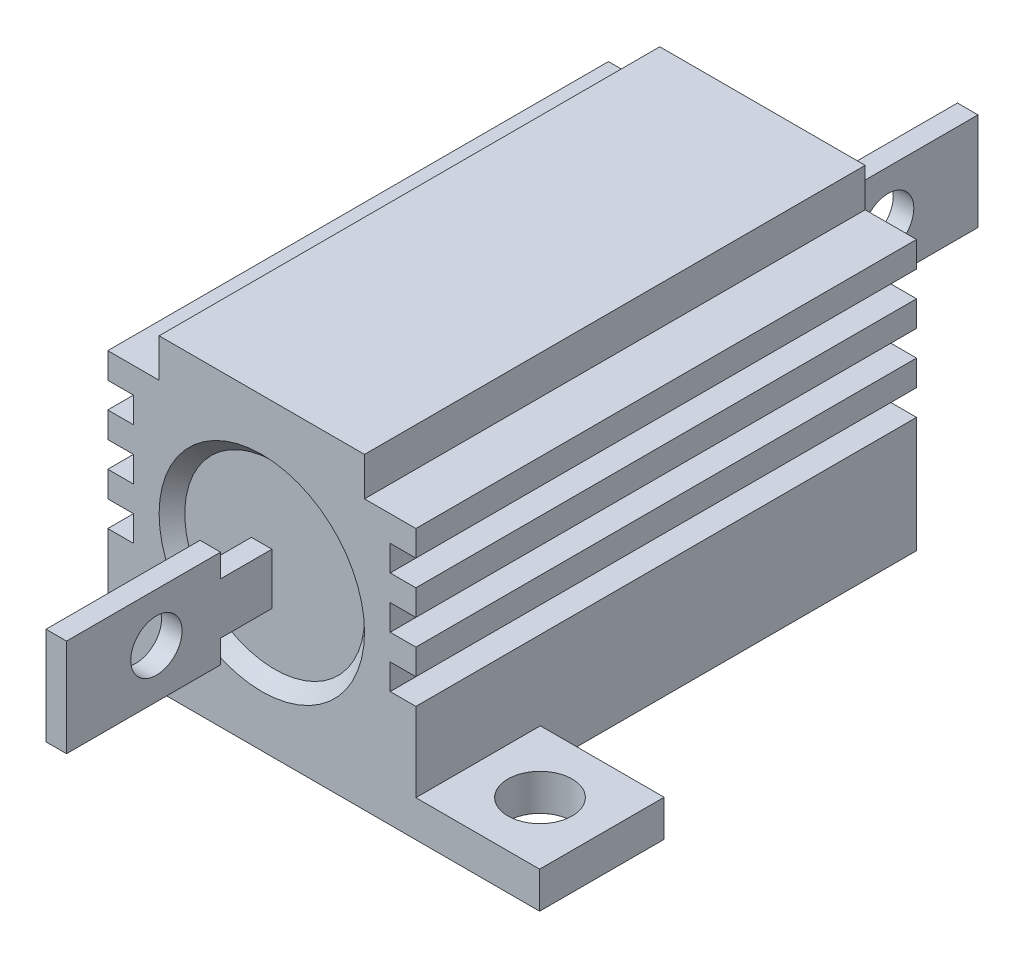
ISO-10303-21;
HEADER;
FILE_DESCRIPTION(('STEP AP214'),'2;1');
FILE_NAME('part.step','',(''),(''),'','','');
FILE_SCHEMA(('AUTOMOTIVE_DESIGN { 1 0 10303 214 1 1 1 1 }'));
ENDSEC;
DATA;
#1=APPLICATION_CONTEXT('core data for automotive mechanical design processes');
#2=APPLICATION_PROTOCOL_DEFINITION('international standard','automotive_design',2000,#1);
#3=PRODUCT_CONTEXT('',#1,'mechanical');
#4=PRODUCT('Part','Part','',(#3));
#5=PRODUCT_RELATED_PRODUCT_CATEGORY('part','',(#4));
#6=PRODUCT_DEFINITION_FORMATION('','',#4);
#7=PRODUCT_DEFINITION_CONTEXT('part definition',#1,'design');
#8=PRODUCT_DEFINITION('design','',#6,#7);
#9=PRODUCT_DEFINITION_SHAPE('','',#8);
#10=(LENGTH_UNIT() NAMED_UNIT(*) SI_UNIT(.MILLI.,.METRE.));
#11=(NAMED_UNIT(*) PLANE_ANGLE_UNIT() SI_UNIT($,.RADIAN.));
#12=(NAMED_UNIT(*) SI_UNIT($,.STERADIAN.) SOLID_ANGLE_UNIT());
#13=UNCERTAINTY_MEASURE_WITH_UNIT(LENGTH_MEASURE(1.E-05),#10,'distance_accuracy_value','');
#14=(GEOMETRIC_REPRESENTATION_CONTEXT(3) GLOBAL_UNCERTAINTY_ASSIGNED_CONTEXT((#13)) GLOBAL_UNIT_ASSIGNED_CONTEXT((#10,
#11,#12)) REPRESENTATION_CONTEXT('',''));
#15=CARTESIAN_POINT('',(0.,0.,0.));
#16=DIRECTION('',(0.,0.,1.));
#17=DIRECTION('',(1.,0.,0.));
#18=AXIS2_PLACEMENT_3D('',#15,#16,#17);
#19=CARTESIAN_POINT('',(-16.1,0.,0.));
#20=DIRECTION('',(1.,0.,0.));
#21=DIRECTION('',(0.,0.,-1.));
#22=AXIS2_PLACEMENT_3D('',#19,#20,#21);
#23=PLANE('',#22);
#24=DIRECTION('',(0.,1.,0.));
#25=VECTOR('',#24,1.);
#26=CARTESIAN_POINT('',(-16.1,7.00000000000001,21.5));
#27=LINE('',#26,#25);
#28=CARTESIAN_POINT('',(-16.1,7.00000000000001,21.5));
#29=VERTEX_POINT('',#28);
#30=CARTESIAN_POINT('',(-16.1,7.90000000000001,21.5));
#31=VERTEX_POINT('',#30);
#32=EDGE_CURVE('E158',#29,#31,#27,.T.);
#33=ORIENTED_EDGE('',*,*,#32,.T.);
#34=DIRECTION('',(0.,0.,1.));
#35=VECTOR('',#34,1.);
#36=CARTESIAN_POINT('',(-16.1,7.90000000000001,21.5));
#37=LINE('',#36,#35);
#38=CARTESIAN_POINT('',(-16.1,7.90000000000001,27.5));
#39=VERTEX_POINT('',#38);
#40=EDGE_CURVE('E106',#31,#39,#37,.T.);
#41=ORIENTED_EDGE('',*,*,#40,.T.);
#42=DIRECTION('',(0.,-1.,0.));
#43=VECTOR('',#42,1.);
#44=CARTESIAN_POINT('',(-16.1,7.90000000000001,27.5));
#45=LINE('',#44,#43);
#46=CARTESIAN_POINT('',(-16.1,4.1,27.5));
#47=VERTEX_POINT('',#46);
#48=EDGE_CURVE('E173',#39,#47,#45,.T.);
#49=ORIENTED_EDGE('',*,*,#48,.T.);
#50=DIRECTION('',(0.,0.,-1.));
#51=VECTOR('',#50,1.);
#52=CARTESIAN_POINT('',(-16.1,4.1,21.5));
#53=LINE('',#52,#51);
#54=CARTESIAN_POINT('',(-16.1,4.1,21.5));
#55=VERTEX_POINT('',#54);
#56=EDGE_CURVE('E186',#47,#55,#53,.T.);
#57=ORIENTED_EDGE('',*,*,#56,.T.);
#58=DIRECTION('',(0.,1.,0.));
#59=VECTOR('',#58,1.);
#60=CARTESIAN_POINT('',(-16.1,5.00000000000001,21.5));
#61=LINE('',#60,#59);
#62=CARTESIAN_POINT('',(-16.1,5.00000000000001,21.5));
#63=VERTEX_POINT('',#62);
#64=EDGE_CURVE('E125',#55,#63,#61,.T.);
#65=ORIENTED_EDGE('',*,*,#64,.T.);
#66=DIRECTION('',(0.,0.,-1.));
#67=VECTOR('',#66,1.);
#68=CARTESIAN_POINT('',(-16.1,5.00000000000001,19.5));
#69=LINE('',#68,#67);
#70=CARTESIAN_POINT('',(-16.1,5.00000000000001,19.5));
#71=VERTEX_POINT('',#70);
#72=EDGE_CURVE('E119',#63,#71,#69,.T.);
#73=ORIENTED_EDGE('',*,*,#72,.T.);
#74=DIRECTION('',(0.,1.,0.));
#75=VECTOR('',#74,1.);
#76=CARTESIAN_POINT('',(-16.1,7.,19.5));
#77=LINE('',#76,#75);
#78=CARTESIAN_POINT('',(-16.1,7.,19.5));
#79=VERTEX_POINT('',#78);
#80=EDGE_CURVE('E123',#71,#79,#77,.T.);
#81=ORIENTED_EDGE('',*,*,#80,.T.);
#82=DIRECTION('',(0.,0.,1.));
#83=VECTOR('',#82,1.);
#84=CARTESIAN_POINT('',(-16.1,7.,19.5));
#85=LINE('',#84,#83);
#86=EDGE_CURVE('E63',#79,#29,#85,.T.);
#87=ORIENTED_EDGE('',*,*,#86,.T.);
#88=EDGE_LOOP('',(#33,#41,#49,#57,#65,#73,#81,#87));
#89=FACE_BOUND('',#88,.T.);
#90=CARTESIAN_POINT('',(-16.1,6.00000000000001,24.));
#91=DIRECTION('',(1.,0.,0.));
#92=DIRECTION('',(0.,0.,1.));
#93=AXIS2_PLACEMENT_3D('',#90,#91,#92);
#94=CIRCLE('',#93,1.);
#95=CARTESIAN_POINT('',(-16.1,6.00000000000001,25.));
#96=VERTEX_POINT('',#95);
#97=EDGE_CURVE('E147',#96,#96,#94,.T.);
#98=ORIENTED_EDGE('',*,*,#97,.F.);
#99=EDGE_LOOP('',(#98));
#100=FACE_BOUND('',#99,.T.);
#101=ADVANCED_FACE('F46',(#89,#100),#23,.T.);
#102=CARTESIAN_POINT('',(-16.9,0.,0.));
#103=DIRECTION('',(1.,0.,0.));
#104=DIRECTION('',(0.,0.,-1.));
#105=AXIS2_PLACEMENT_3D('',#102,#103,#104);
#106=PLANE('',#105);
#107=DIRECTION('',(0.,1.,0.));
#108=VECTOR('',#107,1.);
#109=CARTESIAN_POINT('',(-16.9,7.00000000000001,21.5));
#110=LINE('',#109,#108);
#111=CARTESIAN_POINT('',(-16.9,7.00000000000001,21.5));
#112=VERTEX_POINT('',#111);
#113=CARTESIAN_POINT('',(-16.9,7.90000000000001,21.5));
#114=VERTEX_POINT('',#113);
#115=EDGE_CURVE('E143',#112,#114,#110,.T.);
#116=ORIENTED_EDGE('',*,*,#115,.F.);
#117=DIRECTION('',(0.,0.,1.));
#118=VECTOR('',#117,1.);
#119=CARTESIAN_POINT('',(-16.9,7.,19.5));
#120=LINE('',#119,#118);
#121=CARTESIAN_POINT('',(-16.9,7.,19.5));
#122=VERTEX_POINT('',#121);
#123=EDGE_CURVE('E98',#122,#112,#120,.T.);
#124=ORIENTED_EDGE('',*,*,#123,.F.);
#125=DIRECTION('',(0.,1.,0.));
#126=VECTOR('',#125,1.);
#127=CARTESIAN_POINT('',(-16.9,7.,19.5));
#128=LINE('',#127,#126);
#129=CARTESIAN_POINT('',(-16.9,5.00000000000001,19.5));
#130=VERTEX_POINT('',#129);
#131=EDGE_CURVE('E92',#130,#122,#128,.T.);
#132=ORIENTED_EDGE('',*,*,#131,.F.);
#133=DIRECTION('',(0.,0.,-1.));
#134=VECTOR('',#133,1.);
#135=CARTESIAN_POINT('',(-16.9,5.00000000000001,19.5));
#136=LINE('',#135,#134);
#137=CARTESIAN_POINT('',(-16.9,5.00000000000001,21.5));
#138=VERTEX_POINT('',#137);
#139=EDGE_CURVE('E133',#138,#130,#136,.T.);
#140=ORIENTED_EDGE('',*,*,#139,.F.);
#141=DIRECTION('',(0.,1.,0.));
#142=VECTOR('',#141,1.);
#143=CARTESIAN_POINT('',(-16.9,5.00000000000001,21.5));
#144=LINE('',#143,#142);
#145=CARTESIAN_POINT('',(-16.9,4.1,21.5));
#146=VERTEX_POINT('',#145);
#147=EDGE_CURVE('E153',#146,#138,#144,.T.);
#148=ORIENTED_EDGE('',*,*,#147,.F.);
#149=DIRECTION('',(0.,0.,-1.));
#150=VECTOR('',#149,1.);
#151=CARTESIAN_POINT('',(-16.9,4.1,21.5));
#152=LINE('',#151,#150);
#153=CARTESIAN_POINT('',(-16.9,4.1,27.5));
#154=VERTEX_POINT('',#153);
#155=EDGE_CURVE('E151',#154,#146,#152,.T.);
#156=ORIENTED_EDGE('',*,*,#155,.F.);
#157=DIRECTION('',(0.,-1.,0.));
#158=VECTOR('',#157,1.);
#159=CARTESIAN_POINT('',(-16.9,7.90000000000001,27.5));
#160=LINE('',#159,#158);
#161=CARTESIAN_POINT('',(-16.9,7.90000000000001,27.5));
#162=VERTEX_POINT('',#161);
#163=EDGE_CURVE('E149',#162,#154,#160,.T.);
#164=ORIENTED_EDGE('',*,*,#163,.F.);
#165=DIRECTION('',(0.,0.,1.));
#166=VECTOR('',#165,1.);
#167=CARTESIAN_POINT('',(-16.9,7.90000000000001,21.5));
#168=LINE('',#167,#166);
#169=EDGE_CURVE('E146',#114,#162,#168,.T.);
#170=ORIENTED_EDGE('',*,*,#169,.F.);
#171=EDGE_LOOP('',(#116,#124,#132,#140,#148,#156,#164,#170));
#172=FACE_BOUND('',#171,.T.);
#173=CARTESIAN_POINT('',(-16.9,6.00000000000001,24.));
#174=DIRECTION('',(1.,0.,0.));
#175=DIRECTION('',(0.,0.,1.));
#176=AXIS2_PLACEMENT_3D('',#173,#174,#175);
#177=CIRCLE('',#176,1.);
#178=CARTESIAN_POINT('',(-16.9,6.00000000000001,25.));
#179=VERTEX_POINT('',#178);
#180=EDGE_CURVE('E192',#179,#179,#177,.T.);
#181=ORIENTED_EDGE('',*,*,#180,.T.);
#182=EDGE_LOOP('',(#181));
#183=FACE_BOUND('',#182,.T.);
#184=ADVANCED_FACE('F177',(#172,#183),#106,.F.);
#185=CARTESIAN_POINT('',(-16.1,7.00000000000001,21.5));
#186=DIRECTION('',(0.,0.,1.));
#187=DIRECTION('',(1.,0.,0.));
#188=AXIS2_PLACEMENT_3D('',#185,#186,#187);
#189=PLANE('',#188);
#190=ORIENTED_EDGE('',*,*,#115,.T.);
#191=DIRECTION('',(-1.,0.,0.));
#192=VECTOR('',#191,1.);
#193=CARTESIAN_POINT('',(-16.1,7.90000000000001,21.5));
#194=LINE('',#193,#192);
#195=EDGE_CURVE('E12',#31,#114,#194,.T.);
#196=ORIENTED_EDGE('',*,*,#195,.F.);
#197=ORIENTED_EDGE('',*,*,#32,.F.);
#198=DIRECTION('',(-1.,0.,0.));
#199=VECTOR('',#198,1.);
#200=CARTESIAN_POINT('',(-16.1,7.00000000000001,21.5));
#201=LINE('',#200,#199);
#202=EDGE_CURVE('E139',#29,#112,#201,.T.);
#203=ORIENTED_EDGE('',*,*,#202,.T.);
#204=EDGE_LOOP('',(#190,#196,#197,#203));
#205=FACE_BOUND('',#204,.T.);
#206=ADVANCED_FACE('F48',(#205),#189,.F.);
#207=CARTESIAN_POINT('',(-16.1,7.90000000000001,21.5));
#208=DIRECTION('',(0.,-1.,0.));
#209=DIRECTION('',(0.,0.,-1.));
#210=AXIS2_PLACEMENT_3D('',#207,#208,#209);
#211=PLANE('',#210);
#212=ORIENTED_EDGE('',*,*,#169,.T.);
#213=DIRECTION('',(-1.,0.,0.));
#214=VECTOR('',#213,1.);
#215=CARTESIAN_POINT('',(-16.1,7.90000000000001,27.5));
#216=LINE('',#215,#214);
#217=EDGE_CURVE('E55',#39,#162,#216,.T.);
#218=ORIENTED_EDGE('',*,*,#217,.F.);
#219=ORIENTED_EDGE('',*,*,#40,.F.);
#220=ORIENTED_EDGE('',*,*,#195,.T.);
#221=EDGE_LOOP('',(#212,#218,#219,#220));
#222=FACE_BOUND('',#221,.T.);
#223=ADVANCED_FACE('F220',(#222),#211,.F.);
#224=CARTESIAN_POINT('',(-16.1,7.90000000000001,27.5));
#225=DIRECTION('',(0.,0.,-1.));
#226=DIRECTION('',(-1.,0.,0.));
#227=AXIS2_PLACEMENT_3D('',#224,#225,#226);
#228=PLANE('',#227);
#229=ORIENTED_EDGE('',*,*,#163,.T.);
#230=DIRECTION('',(-1.,0.,0.));
#231=VECTOR('',#230,1.);
#232=CARTESIAN_POINT('',(-16.1,4.1,27.5));
#233=LINE('',#232,#231);
#234=EDGE_CURVE('E165',#47,#154,#233,.T.);
#235=ORIENTED_EDGE('',*,*,#234,.F.);
#236=ORIENTED_EDGE('',*,*,#48,.F.);
#237=ORIENTED_EDGE('',*,*,#217,.T.);
#238=EDGE_LOOP('',(#229,#235,#236,#237));
#239=FACE_BOUND('',#238,.T.);
#240=ADVANCED_FACE('F171',(#239),#228,.F.);
#241=CARTESIAN_POINT('',(-16.1,4.1,21.5));
#242=DIRECTION('',(0.,1.,0.));
#243=DIRECTION('',(0.,0.,1.));
#244=AXIS2_PLACEMENT_3D('',#241,#242,#243);
#245=PLANE('',#244);
#246=ORIENTED_EDGE('',*,*,#155,.T.);
#247=DIRECTION('',(-1.,0.,0.));
#248=VECTOR('',#247,1.);
#249=CARTESIAN_POINT('',(-16.1,4.1,21.5));
#250=LINE('',#249,#248);
#251=EDGE_CURVE('E162',#55,#146,#250,.T.);
#252=ORIENTED_EDGE('',*,*,#251,.F.);
#253=ORIENTED_EDGE('',*,*,#56,.F.);
#254=ORIENTED_EDGE('',*,*,#234,.T.);
#255=EDGE_LOOP('',(#246,#252,#253,#254));
#256=FACE_BOUND('',#255,.T.);
#257=ADVANCED_FACE('F182',(#256),#245,.F.);
#258=CARTESIAN_POINT('',(-16.1,5.00000000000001,21.5));
#259=DIRECTION('',(0.,0.,1.));
#260=DIRECTION('',(1.,0.,0.));
#261=AXIS2_PLACEMENT_3D('',#258,#259,#260);
#262=PLANE('',#261);
#263=ORIENTED_EDGE('',*,*,#147,.T.);
#264=DIRECTION('',(-1.,0.,0.));
#265=VECTOR('',#264,1.);
#266=CARTESIAN_POINT('',(-16.1,5.00000000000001,21.5));
#267=LINE('',#266,#265);
#268=EDGE_CURVE('E134',#63,#138,#267,.T.);
#269=ORIENTED_EDGE('',*,*,#268,.F.);
#270=ORIENTED_EDGE('',*,*,#64,.F.);
#271=ORIENTED_EDGE('',*,*,#251,.T.);
#272=EDGE_LOOP('',(#263,#269,#270,#271));
#273=FACE_BOUND('',#272,.T.);
#274=ADVANCED_FACE('F185',(#273),#262,.F.);
#275=CARTESIAN_POINT('',(-16.1,5.00000000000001,19.5));
#276=DIRECTION('',(0.,1.,0.));
#277=DIRECTION('',(0.,0.,1.));
#278=AXIS2_PLACEMENT_3D('',#275,#276,#277);
#279=PLANE('',#278);
#280=ORIENTED_EDGE('',*,*,#139,.T.);
#281=DIRECTION('',(-1.,0.,0.));
#282=VECTOR('',#281,1.);
#283=CARTESIAN_POINT('',(-16.1,5.00000000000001,19.5));
#284=LINE('',#283,#282);
#285=EDGE_CURVE('E130',#71,#130,#284,.T.);
#286=ORIENTED_EDGE('',*,*,#285,.F.);
#287=ORIENTED_EDGE('',*,*,#72,.F.);
#288=ORIENTED_EDGE('',*,*,#268,.T.);
#289=EDGE_LOOP('',(#280,#286,#287,#288));
#290=FACE_BOUND('',#289,.T.);
#291=ADVANCED_FACE('F131',(#290),#279,.F.);
#292=CARTESIAN_POINT('',(-16.1,7.,19.5));
#293=DIRECTION('',(0.,0.,1.));
#294=DIRECTION('',(1.,0.,0.));
#295=AXIS2_PLACEMENT_3D('',#292,#293,#294);
#296=PLANE('',#295);
#297=ORIENTED_EDGE('',*,*,#131,.T.);
#298=DIRECTION('',(-1.,0.,0.));
#299=VECTOR('',#298,1.);
#300=CARTESIAN_POINT('',(-16.1,7.,19.5));
#301=LINE('',#300,#299);
#302=EDGE_CURVE('E135',#79,#122,#301,.T.);
#303=ORIENTED_EDGE('',*,*,#302,.F.);
#304=ORIENTED_EDGE('',*,*,#80,.F.);
#305=ORIENTED_EDGE('',*,*,#285,.T.);
#306=EDGE_LOOP('',(#297,#303,#304,#305));
#307=FACE_BOUND('',#306,.T.);
#308=ADVANCED_FACE('F137',(#307),#296,.F.);
#309=CARTESIAN_POINT('',(-16.1,7.,19.5));
#310=DIRECTION('',(0.,-1.,0.));
#311=DIRECTION('',(0.,0.,-1.));
#312=AXIS2_PLACEMENT_3D('',#309,#310,#311);
#313=PLANE('',#312);
#314=ORIENTED_EDGE('',*,*,#123,.T.);
#315=ORIENTED_EDGE('',*,*,#202,.F.);
#316=ORIENTED_EDGE('',*,*,#86,.F.);
#317=ORIENTED_EDGE('',*,*,#302,.T.);
#318=EDGE_LOOP('',(#314,#315,#316,#317));
#319=FACE_BOUND('',#318,.T.);
#320=ADVANCED_FACE('F208',(#319),#313,.F.);
#321=CARTESIAN_POINT('',(-16.1,6.00000000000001,24.));
#322=DIRECTION('',(-1.,0.,0.));
#323=DIRECTION('',(0.,0.,1.));
#324=AXIS2_PLACEMENT_3D('',#321,#322,#323);
#325=CYLINDRICAL_SURFACE('',#324,1.);
#326=ORIENTED_EDGE('',*,*,#97,.T.);
#327=EDGE_LOOP('',(#326));
#328=FACE_BOUND('',#327,.T.);
#329=ORIENTED_EDGE('',*,*,#180,.F.);
#330=EDGE_LOOP('',(#329));
#331=FACE_BOUND('',#330,.T.);
#332=ADVANCED_FACE('F198',(#328,#331),#325,.F.);
#333=CLOSED_SHELL('',(#101,#184,#206,#223,#240,#257,#274,#291,#308,#320,#332));
#334=MANIFOLD_SOLID_BREP('B2',#333);
#335=CARTESIAN_POINT('',(-16.1,0.,0.));
#336=DIRECTION('',(1.,0.,0.));
#337=DIRECTION('',(0.,0.,-1.));
#338=AXIS2_PLACEMENT_3D('',#335,#336,#337);
#339=PLANE('',#338);
#340=DIRECTION('',(0.,-1.,0.));
#341=VECTOR('',#340,1.);
#342=CARTESIAN_POINT('',(-16.1,7.,0.));
#343=LINE('',#342,#341);
#344=CARTESIAN_POINT('',(-16.1,7.,0.));
#345=VERTEX_POINT('',#344);
#346=CARTESIAN_POINT('',(-16.1,5.00000000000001,0.));
#347=VERTEX_POINT('',#346);
#348=EDGE_CURVE('E416',#345,#347,#343,.T.);
#349=ORIENTED_EDGE('',*,*,#348,.T.);
#350=DIRECTION('',(0.,0.,-1.));
#351=VECTOR('',#350,1.);
#352=CARTESIAN_POINT('',(-16.1,5.00000000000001,0.));
#353=LINE('',#352,#351);
#354=CARTESIAN_POINT('',(-16.1,5.00000000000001,-2.));
#355=VERTEX_POINT('',#354);
#356=EDGE_CURVE('E364',#347,#355,#353,.T.);
#357=ORIENTED_EDGE('',*,*,#356,.T.);
#358=DIRECTION('',(0.,-1.,0.));
#359=VECTOR('',#358,1.);
#360=CARTESIAN_POINT('',(-16.1,5.00000000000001,-2.));
#361=LINE('',#360,#359);
#362=CARTESIAN_POINT('',(-16.1,4.1,-2.));
#363=VERTEX_POINT('',#362);
#364=EDGE_CURVE('E431',#355,#363,#361,.T.);
#365=ORIENTED_EDGE('',*,*,#364,.T.);
#366=DIRECTION('',(0.,0.,-1.));
#367=VECTOR('',#366,1.);
#368=CARTESIAN_POINT('',(-16.1,4.1,-2.));
#369=LINE('',#368,#367);
#370=CARTESIAN_POINT('',(-16.1,4.1,-8.));
#371=VERTEX_POINT('',#370);
#372=EDGE_CURVE('E444',#363,#371,#369,.T.);
#373=ORIENTED_EDGE('',*,*,#372,.T.);
#374=DIRECTION('',(0.,1.,0.));
#375=VECTOR('',#374,1.);
#376=CARTESIAN_POINT('',(-16.1,7.90000000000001,-8.));
#377=LINE('',#376,#375);
#378=CARTESIAN_POINT('',(-16.1,7.90000000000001,-8.));
#379=VERTEX_POINT('',#378);
#380=EDGE_CURVE('E383',#371,#379,#377,.T.);
#381=ORIENTED_EDGE('',*,*,#380,.T.);
#382=DIRECTION('',(0.,0.,1.));
#383=VECTOR('',#382,1.);
#384=CARTESIAN_POINT('',(-16.1,7.90000000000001,-2.));
#385=LINE('',#384,#383);
#386=CARTESIAN_POINT('',(-16.1,7.90000000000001,-2.));
#387=VERTEX_POINT('',#386);
#388=EDGE_CURVE('E377',#379,#387,#385,.T.);
#389=ORIENTED_EDGE('',*,*,#388,.T.);
#390=DIRECTION('',(0.,-1.,0.));
#391=VECTOR('',#390,1.);
#392=CARTESIAN_POINT('',(-16.1,7.00000000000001,-2.));
#393=LINE('',#392,#391);
#394=CARTESIAN_POINT('',(-16.1,7.00000000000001,-2.));
#395=VERTEX_POINT('',#394);
#396=EDGE_CURVE('E381',#387,#395,#393,.T.);
#397=ORIENTED_EDGE('',*,*,#396,.T.);
#398=DIRECTION('',(0.,0.,1.));
#399=VECTOR('',#398,1.);
#400=CARTESIAN_POINT('',(-16.1,7.,0.));
#401=LINE('',#400,#399);
#402=EDGE_CURVE('E321',#395,#345,#401,.T.);
#403=ORIENTED_EDGE('',*,*,#402,.T.);
#404=EDGE_LOOP('',(#349,#357,#365,#373,#381,#389,#397,#403));
#405=FACE_BOUND('',#404,.T.);
#406=CARTESIAN_POINT('',(-16.1,6.00000000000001,-4.5));
#407=DIRECTION('',(1.,0.,0.));
#408=DIRECTION('',(0.,0.,-1.));
#409=AXIS2_PLACEMENT_3D('',#406,#407,#408);
#410=CIRCLE('',#409,1.);
#411=CARTESIAN_POINT('',(-16.1,6.00000000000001,-5.5));
#412=VERTEX_POINT('',#411);
#413=EDGE_CURVE('E405',#412,#412,#410,.T.);
#414=ORIENTED_EDGE('',*,*,#413,.F.);
#415=EDGE_LOOP('',(#414));
#416=FACE_BOUND('',#415,.T.);
#417=ADVANCED_FACE('F304',(#405,#416),#339,.T.);
#418=CARTESIAN_POINT('',(-16.9,0.,0.));
#419=DIRECTION('',(1.,0.,0.));
#420=DIRECTION('',(0.,0.,-1.));
#421=AXIS2_PLACEMENT_3D('',#418,#419,#420);
#422=PLANE('',#421);
#423=DIRECTION('',(0.,-1.,0.));
#424=VECTOR('',#423,1.);
#425=CARTESIAN_POINT('',(-16.9,7.,0.));
#426=LINE('',#425,#424);
#427=CARTESIAN_POINT('',(-16.9,7.,0.));
#428=VERTEX_POINT('',#427);
#429=CARTESIAN_POINT('',(-16.9,5.00000000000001,0.));
#430=VERTEX_POINT('',#429);
#431=EDGE_CURVE('E401',#428,#430,#426,.T.);
#432=ORIENTED_EDGE('',*,*,#431,.F.);
#433=DIRECTION('',(0.,0.,1.));
#434=VECTOR('',#433,1.);
#435=CARTESIAN_POINT('',(-16.9,7.,0.));
#436=LINE('',#435,#434);
#437=CARTESIAN_POINT('',(-16.9,7.00000000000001,-2.));
#438=VERTEX_POINT('',#437);
#439=EDGE_CURVE('E356',#438,#428,#436,.T.);
#440=ORIENTED_EDGE('',*,*,#439,.F.);
#441=DIRECTION('',(0.,-1.,0.));
#442=VECTOR('',#441,1.);
#443=CARTESIAN_POINT('',(-16.9,7.00000000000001,-2.));
#444=LINE('',#443,#442);
#445=CARTESIAN_POINT('',(-16.9,7.90000000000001,-2.));
#446=VERTEX_POINT('',#445);
#447=EDGE_CURVE('E350',#446,#438,#444,.T.);
#448=ORIENTED_EDGE('',*,*,#447,.F.);
#449=DIRECTION('',(0.,0.,1.));
#450=VECTOR('',#449,1.);
#451=CARTESIAN_POINT('',(-16.9,7.90000000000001,-2.));
#452=LINE('',#451,#450);
#453=CARTESIAN_POINT('',(-16.9,7.90000000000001,-8.));
#454=VERTEX_POINT('',#453);
#455=EDGE_CURVE('E391',#454,#446,#452,.T.);
#456=ORIENTED_EDGE('',*,*,#455,.F.);
#457=DIRECTION('',(0.,1.,0.));
#458=VECTOR('',#457,1.);
#459=CARTESIAN_POINT('',(-16.9,7.90000000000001,-8.));
#460=LINE('',#459,#458);
#461=CARTESIAN_POINT('',(-16.9,4.1,-8.));
#462=VERTEX_POINT('',#461);
#463=EDGE_CURVE('E411',#462,#454,#460,.T.);
#464=ORIENTED_EDGE('',*,*,#463,.F.);
#465=DIRECTION('',(0.,0.,-1.));
#466=VECTOR('',#465,1.);
#467=CARTESIAN_POINT('',(-16.9,4.1,-2.));
#468=LINE('',#467,#466);
#469=CARTESIAN_POINT('',(-16.9,4.1,-2.));
#470=VERTEX_POINT('',#469);
#471=EDGE_CURVE('E409',#470,#462,#468,.T.);
#472=ORIENTED_EDGE('',*,*,#471,.F.);
#473=DIRECTION('',(0.,-1.,0.));
#474=VECTOR('',#473,1.);
#475=CARTESIAN_POINT('',(-16.9,5.00000000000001,-2.));
#476=LINE('',#475,#474);
#477=CARTESIAN_POINT('',(-16.9,5.00000000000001,-2.));
#478=VERTEX_POINT('',#477);
#479=EDGE_CURVE('E407',#478,#470,#476,.T.);
#480=ORIENTED_EDGE('',*,*,#479,.F.);
#481=DIRECTION('',(0.,0.,-1.));
#482=VECTOR('',#481,1.);
#483=CARTESIAN_POINT('',(-16.9,5.00000000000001,0.));
#484=LINE('',#483,#482);
#485=EDGE_CURVE('E404',#430,#478,#484,.T.);
#486=ORIENTED_EDGE('',*,*,#485,.F.);
#487=EDGE_LOOP('',(#432,#440,#448,#456,#464,#472,#480,#486));
#488=FACE_BOUND('',#487,.T.);
#489=CARTESIAN_POINT('',(-16.9,6.00000000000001,-4.5));
#490=DIRECTION('',(1.,0.,0.));
#491=DIRECTION('',(0.,0.,-1.));
#492=AXIS2_PLACEMENT_3D('',#489,#490,#491);
#493=CIRCLE('',#492,1.);
#494=CARTESIAN_POINT('',(-16.9,6.00000000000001,-5.5));
#495=VERTEX_POINT('',#494);
#496=EDGE_CURVE('E450',#495,#495,#493,.T.);
#497=ORIENTED_EDGE('',*,*,#496,.T.);
#498=EDGE_LOOP('',(#497));
#499=FACE_BOUND('',#498,.T.);
#500=ADVANCED_FACE('F435',(#488,#499),#422,.F.);
#501=CARTESIAN_POINT('',(-16.1,7.,0.));
#502=DIRECTION('',(0.,0.,-1.));
#503=DIRECTION('',(-1.,0.,0.));
#504=AXIS2_PLACEMENT_3D('',#501,#502,#503);
#505=PLANE('',#504);
#506=ORIENTED_EDGE('',*,*,#431,.T.);
#507=DIRECTION('',(-1.,0.,0.));
#508=VECTOR('',#507,1.);
#509=CARTESIAN_POINT('',(-16.1,5.00000000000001,0.));
#510=LINE('',#509,#508);
#511=EDGE_CURVE('E44',#347,#430,#510,.T.);
#512=ORIENTED_EDGE('',*,*,#511,.F.);
#513=ORIENTED_EDGE('',*,*,#348,.F.);
#514=DIRECTION('',(-1.,0.,0.));
#515=VECTOR('',#514,1.);
#516=CARTESIAN_POINT('',(-16.1,7.,0.));
#517=LINE('',#516,#515);
#518=EDGE_CURVE('E397',#345,#428,#517,.T.);
#519=ORIENTED_EDGE('',*,*,#518,.T.);
#520=EDGE_LOOP('',(#506,#512,#513,#519));
#521=FACE_BOUND('',#520,.T.);
#522=ADVANCED_FACE('F306',(#521),#505,.F.);
#523=CARTESIAN_POINT('',(-16.1,5.00000000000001,0.));
#524=DIRECTION('',(0.,1.,0.));
#525=DIRECTION('',(0.,0.,1.));
#526=AXIS2_PLACEMENT_3D('',#523,#524,#525);
#527=PLANE('',#526);
#528=ORIENTED_EDGE('',*,*,#485,.T.);
#529=DIRECTION('',(-1.,0.,0.));
#530=VECTOR('',#529,1.);
#531=CARTESIAN_POINT('',(-16.1,5.00000000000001,-2.));
#532=LINE('',#531,#530);
#533=EDGE_CURVE('E313',#355,#478,#532,.T.);
#534=ORIENTED_EDGE('',*,*,#533,.F.);
#535=ORIENTED_EDGE('',*,*,#356,.F.);
#536=ORIENTED_EDGE('',*,*,#511,.T.);
#537=EDGE_LOOP('',(#528,#534,#535,#536));
#538=FACE_BOUND('',#537,.T.);
#539=ADVANCED_FACE('F478',(#538),#527,.F.);
#540=CARTESIAN_POINT('',(-16.1,5.00000000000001,-2.));
#541=DIRECTION('',(0.,0.,-1.));
#542=DIRECTION('',(0.,1.,0.));
#543=AXIS2_PLACEMENT_3D('',#540,#541,#542);
#544=PLANE('',#543);
#545=ORIENTED_EDGE('',*,*,#479,.T.);
#546=DIRECTION('',(-1.,0.,0.));
#547=VECTOR('',#546,1.);
#548=CARTESIAN_POINT('',(-16.1,4.1,-2.));
#549=LINE('',#548,#547);
#550=EDGE_CURVE('E423',#363,#470,#549,.T.);
#551=ORIENTED_EDGE('',*,*,#550,.F.);
#552=ORIENTED_EDGE('',*,*,#364,.F.);
#553=ORIENTED_EDGE('',*,*,#533,.T.);
#554=EDGE_LOOP('',(#545,#551,#552,#553));
#555=FACE_BOUND('',#554,.T.);
#556=ADVANCED_FACE('F429',(#555),#544,.F.);
#557=CARTESIAN_POINT('',(-16.1,4.1,-2.));
#558=DIRECTION('',(0.,1.,0.));
#559=DIRECTION('',(0.,0.,1.));
#560=AXIS2_PLACEMENT_3D('',#557,#558,#559);
#561=PLANE('',#560);
#562=ORIENTED_EDGE('',*,*,#471,.T.);
#563=DIRECTION('',(-1.,0.,0.));
#564=VECTOR('',#563,1.);
#565=CARTESIAN_POINT('',(-16.1,4.1,-8.));
#566=LINE('',#565,#564);
#567=EDGE_CURVE('E420',#371,#462,#566,.T.);
#568=ORIENTED_EDGE('',*,*,#567,.F.);
#569=ORIENTED_EDGE('',*,*,#372,.F.);
#570=ORIENTED_EDGE('',*,*,#550,.T.);
#571=EDGE_LOOP('',(#562,#568,#569,#570));
#572=FACE_BOUND('',#571,.T.);
#573=ADVANCED_FACE('F440',(#572),#561,.F.);
#574=CARTESIAN_POINT('',(-16.1,7.90000000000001,-8.));
#575=DIRECTION('',(0.,0.,1.));
#576=DIRECTION('',(1.,0.,0.));
#577=AXIS2_PLACEMENT_3D('',#574,#575,#576);
#578=PLANE('',#577);
#579=ORIENTED_EDGE('',*,*,#463,.T.);
#580=DIRECTION('',(-1.,0.,0.));
#581=VECTOR('',#580,1.);
#582=CARTESIAN_POINT('',(-16.1,7.90000000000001,-8.));
#583=LINE('',#582,#581);
#584=EDGE_CURVE('E392',#379,#454,#583,.T.);
#585=ORIENTED_EDGE('',*,*,#584,.F.);
#586=ORIENTED_EDGE('',*,*,#380,.F.);
#587=ORIENTED_EDGE('',*,*,#567,.T.);
#588=EDGE_LOOP('',(#579,#585,#586,#587));
#589=FACE_BOUND('',#588,.T.);
#590=ADVANCED_FACE('F443',(#589),#578,.F.);
#591=CARTESIAN_POINT('',(-16.1,7.90000000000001,-2.));
#592=DIRECTION('',(0.,-1.,0.));
#593=DIRECTION('',(0.,0.,-1.));
#594=AXIS2_PLACEMENT_3D('',#591,#592,#593);
#595=PLANE('',#594);
#596=ORIENTED_EDGE('',*,*,#455,.T.);
#597=DIRECTION('',(-1.,0.,0.));
#598=VECTOR('',#597,1.);
#599=CARTESIAN_POINT('',(-16.1,7.90000000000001,-2.));
#600=LINE('',#599,#598);
#601=EDGE_CURVE('E388',#387,#446,#600,.T.);
#602=ORIENTED_EDGE('',*,*,#601,.F.);
#603=ORIENTED_EDGE('',*,*,#388,.F.);
#604=ORIENTED_EDGE('',*,*,#584,.T.);
#605=EDGE_LOOP('',(#596,#602,#603,#604));
#606=FACE_BOUND('',#605,.T.);
#607=ADVANCED_FACE('F389',(#606),#595,.F.);
#608=CARTESIAN_POINT('',(-16.1,7.00000000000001,-2.));
#609=DIRECTION('',(0.,0.,-1.));
#610=DIRECTION('',(0.,1.,0.));
#611=AXIS2_PLACEMENT_3D('',#608,#609,#610);
#612=PLANE('',#611);
#613=ORIENTED_EDGE('',*,*,#447,.T.);
#614=DIRECTION('',(-1.,0.,0.));
#615=VECTOR('',#614,1.);
#616=CARTESIAN_POINT('',(-16.1,7.00000000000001,-2.));
#617=LINE('',#616,#615);
#618=EDGE_CURVE('E393',#395,#438,#617,.T.);
#619=ORIENTED_EDGE('',*,*,#618,.F.);
#620=ORIENTED_EDGE('',*,*,#396,.F.);
#621=ORIENTED_EDGE('',*,*,#601,.T.);
#622=EDGE_LOOP('',(#613,#619,#620,#621));
#623=FACE_BOUND('',#622,.T.);
#624=ADVANCED_FACE('F395',(#623),#612,.F.);
#625=CARTESIAN_POINT('',(-16.1,7.,0.));
#626=DIRECTION('',(0.,-1.,0.));
#627=DIRECTION('',(0.,0.,-1.));
#628=AXIS2_PLACEMENT_3D('',#625,#626,#627);
#629=PLANE('',#628);
#630=ORIENTED_EDGE('',*,*,#439,.T.);
#631=ORIENTED_EDGE('',*,*,#518,.F.);
#632=ORIENTED_EDGE('',*,*,#402,.F.);
#633=ORIENTED_EDGE('',*,*,#618,.T.);
#634=EDGE_LOOP('',(#630,#631,#632,#633));
#635=FACE_BOUND('',#634,.T.);
#636=ADVANCED_FACE('F466',(#635),#629,.F.);
#637=CARTESIAN_POINT('',(-16.1,6.00000000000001,-4.5));
#638=DIRECTION('',(-1.,0.,0.));
#639=DIRECTION('',(0.,0.,1.));
#640=AXIS2_PLACEMENT_3D('',#637,#638,#639);
#641=CYLINDRICAL_SURFACE('',#640,1.);
#642=ORIENTED_EDGE('',*,*,#413,.T.);
#643=EDGE_LOOP('',(#642));
#644=FACE_BOUND('',#643,.T.);
#645=ORIENTED_EDGE('',*,*,#496,.F.);
#646=EDGE_LOOP('',(#645));
#647=FACE_BOUND('',#646,.T.);
#648=ADVANCED_FACE('F456',(#644,#647),#641,.F.);
#649=CLOSED_SHELL('',(#417,#500,#522,#539,#556,#573,#590,#607,#624,#636,#648));
#650=MANIFOLD_SOLID_BREP('B6',#649);
#651=CARTESIAN_POINT('',(-22.4943022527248,0.,19.5));
#652=DIRECTION('',(1.,0.,0.));
#653=DIRECTION('',(0.,0.,-1.));
#654=AXIS2_PLACEMENT_3D('',#651,#652,#653);
#655=PLANE('',#654);
#656=DIRECTION('',(0.,1.,0.));
#657=VECTOR('',#656,1.);
#658=CARTESIAN_POINT('',(-22.4943022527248,0.,4.82));
#659=LINE('',#658,#657);
#660=CARTESIAN_POINT('',(-22.4943022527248,0.,4.82));
#661=VERTEX_POINT('',#660);
#662=CARTESIAN_POINT('',(-22.4943022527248,1.42,4.82));
#663=VERTEX_POINT('',#662);
#664=EDGE_CURVE('E572',#661,#663,#659,.T.);
#665=ORIENTED_EDGE('',*,*,#664,.F.);
#666=DIRECTION('',(0.,0.,-1.));
#667=VECTOR('',#666,1.);
#668=CARTESIAN_POINT('',(-22.4943022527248,0.,19.5));
#669=LINE('',#668,#667);
#670=CARTESIAN_POINT('',(-22.4943022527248,0.,19.5));
#671=VERTEX_POINT('',#670);
#672=EDGE_CURVE('E1077',#671,#661,#669,.T.);
#673=ORIENTED_EDGE('',*,*,#672,.F.);
#674=DIRECTION('',(0.,-1.,0.));
#675=VECTOR('',#674,1.);
#676=CARTESIAN_POINT('',(-22.4943022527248,0.,19.5));
#677=LINE('',#676,#675);
#678=CARTESIAN_POINT('',(-22.4943022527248,4.50000000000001,19.5));
#679=VERTEX_POINT('',#678);
#680=EDGE_CURVE('E860',#679,#671,#677,.T.);
#681=ORIENTED_EDGE('',*,*,#680,.F.);
#682=DIRECTION('',(0.,0.,-1.));
#683=VECTOR('',#682,1.);
#684=CARTESIAN_POINT('',(-22.4943022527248,4.50000000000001,19.5));
#685=LINE('',#684,#683);
#686=CARTESIAN_POINT('',(-22.4943022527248,4.50000000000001,0.));
#687=VERTEX_POINT('',#686);
#688=EDGE_CURVE('E926',#679,#687,#685,.T.);
#689=ORIENTED_EDGE('',*,*,#688,.T.);
#690=DIRECTION('',(0.,-1.,0.));
#691=VECTOR('',#690,1.);
#692=CARTESIAN_POINT('',(-22.4943022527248,0.,0.));
#693=LINE('',#692,#691);
#694=CARTESIAN_POINT('',(-22.4943022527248,1.42,0.));
#695=VERTEX_POINT('',#694);
#696=EDGE_CURVE('E809',#687,#695,#693,.T.);
#697=ORIENTED_EDGE('',*,*,#696,.T.);
#698=DIRECTION('',(0.,0.,-1.));
#699=VECTOR('',#698,1.);
#700=CARTESIAN_POINT('',(-22.4943022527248,1.42,0.));
#701=LINE('',#700,#699);
#702=EDGE_CURVE('E568',#663,#695,#701,.T.);
#703=ORIENTED_EDGE('',*,*,#702,.F.);
#704=EDGE_LOOP('',(#665,#673,#681,#689,#697,#703));
#705=FACE_BOUND('',#704,.T.);
#706=ADVANCED_FACE('F553',(#705),#655,.F.);
#707=CARTESIAN_POINT('',(-10.4943022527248,0.,19.5));
#708=DIRECTION('',(-1.,0.,0.));
#709=DIRECTION('',(0.,0.,1.));
#710=AXIS2_PLACEMENT_3D('',#707,#708,#709);
#711=PLANE('',#710);
#712=DIRECTION('',(0.,1.,0.));
#713=VECTOR('',#712,1.);
#714=CARTESIAN_POINT('',(-10.4943022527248,0.,14.65));
#715=LINE('',#714,#713);
#716=CARTESIAN_POINT('',(-10.4943022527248,0.,14.65));
#717=VERTEX_POINT('',#716);
#718=CARTESIAN_POINT('',(-10.4943022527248,1.42,14.65));
#719=VERTEX_POINT('',#718);
#720=EDGE_CURVE('E839',#717,#719,#715,.T.);
#721=ORIENTED_EDGE('',*,*,#720,.F.);
#722=DIRECTION('',(0.,0.,-1.));
#723=VECTOR('',#722,1.);
#724=CARTESIAN_POINT('',(-10.4943022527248,0.,19.5));
#725=LINE('',#724,#723);
#726=CARTESIAN_POINT('',(-10.4943022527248,0.,0.));
#727=VERTEX_POINT('',#726);
#728=EDGE_CURVE('E1075',#717,#727,#725,.T.);
#729=ORIENTED_EDGE('',*,*,#728,.T.);
#730=DIRECTION('',(0.,1.,0.));
#731=VECTOR('',#730,1.);
#732=CARTESIAN_POINT('',(-10.4943022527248,0.,0.));
#733=LINE('',#732,#731);
#734=CARTESIAN_POINT('',(-10.4943022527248,4.50000000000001,0.));
#735=VERTEX_POINT('',#734);
#736=EDGE_CURVE('E806',#727,#735,#733,.T.);
#737=ORIENTED_EDGE('',*,*,#736,.T.);
#738=DIRECTION('',(0.,0.,-1.));
#739=VECTOR('',#738,1.);
#740=CARTESIAN_POINT('',(-10.4943022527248,4.50000000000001,19.5));
#741=LINE('',#740,#739);
#742=CARTESIAN_POINT('',(-10.4943022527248,4.50000000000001,19.5));
#743=VERTEX_POINT('',#742);
#744=EDGE_CURVE('E1072',#743,#735,#741,.T.);
#745=ORIENTED_EDGE('',*,*,#744,.F.);
#746=DIRECTION('',(0.,1.,0.));
#747=VECTOR('',#746,1.);
#748=CARTESIAN_POINT('',(-10.4943022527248,0.,19.5));
#749=LINE('',#748,#747);
#750=CARTESIAN_POINT('',(-10.4943022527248,1.42,19.5));
#751=VERTEX_POINT('',#750);
#752=EDGE_CURVE('E866',#751,#743,#749,.T.);
#753=ORIENTED_EDGE('',*,*,#752,.F.);
#754=DIRECTION('',(0.,0.,1.));
#755=VECTOR('',#754,1.);
#756=CARTESIAN_POINT('',(-10.4943022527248,1.42,19.5));
#757=LINE('',#756,#755);
#758=EDGE_CURVE('E844',#719,#751,#757,.T.);
#759=ORIENTED_EDGE('',*,*,#758,.F.);
#760=EDGE_LOOP('',(#721,#729,#737,#745,#753,#759));
#761=FACE_BOUND('',#760,.T.);
#762=ADVANCED_FACE('F1124',(#761),#711,.F.);
#763=CARTESIAN_POINT('',(-10.4943022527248,0.,19.5));
#764=DIRECTION('',(0.,1.,0.));
#765=DIRECTION('',(0.,0.,1.));
#766=AXIS2_PLACEMENT_3D('',#763,#764,#765);
#767=PLANE('',#766);
#768=CARTESIAN_POINT('',(-8.08430225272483,0.,17.075));
#769=DIRECTION('',(0.,1.,0.));
#770=DIRECTION('',(0.,0.,1.));
#771=AXIS2_PLACEMENT_3D('',#768,#769,#770);
#772=CIRCLE('',#771,1.25);
#773=CARTESIAN_POINT('',(-8.08430225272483,0.,18.325));
#774=VERTEX_POINT('',#773);
#775=EDGE_CURVE('E1097',#774,#774,#772,.T.);
#776=ORIENTED_EDGE('',*,*,#775,.T.);
#777=EDGE_LOOP('',(#776));
#778=FACE_BOUND('',#777,.T.);
#779=CARTESIAN_POINT('',(-24.9043022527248,0.,2.41));
#780=DIRECTION('',(0.,1.,0.));
#781=DIRECTION('',(0.,0.,1.));
#782=AXIS2_PLACEMENT_3D('',#779,#780,#781);
#783=CIRCLE('',#782,1.25);
#784=CARTESIAN_POINT('',(-24.9043022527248,0.,3.66));
#785=VERTEX_POINT('',#784);
#786=EDGE_CURVE('E827',#785,#785,#783,.T.);
#787=ORIENTED_EDGE('',*,*,#786,.T.);
#788=EDGE_LOOP('',(#787));
#789=FACE_BOUND('',#788,.T.);
#790=DIRECTION('',(1.,0.,0.));
#791=VECTOR('',#790,1.);
#792=CARTESIAN_POINT('',(-10.4943022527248,0.,0.));
#793=LINE('',#792,#791);
#794=CARTESIAN_POINT('',(-27.3143022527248,0.,0.));
#795=VERTEX_POINT('',#794);
#796=EDGE_CURVE('E798',#795,#727,#793,.T.);
#797=ORIENTED_EDGE('',*,*,#796,.T.);
#798=ORIENTED_EDGE('',*,*,#728,.F.);
#799=DIRECTION('',(-1.,0.,0.));
#800=VECTOR('',#799,1.);
#801=CARTESIAN_POINT('',(-5.67430225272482,0.,14.65));
#802=LINE('',#801,#800);
#803=CARTESIAN_POINT('',(-5.67430225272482,0.,14.65));
#804=VERTEX_POINT('',#803);
#805=EDGE_CURVE('E858',#804,#717,#802,.T.);
#806=ORIENTED_EDGE('',*,*,#805,.F.);
#807=DIRECTION('',(0.,0.,-1.));
#808=VECTOR('',#807,1.);
#809=CARTESIAN_POINT('',(-5.67430225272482,0.,19.5));
#810=LINE('',#809,#808);
#811=CARTESIAN_POINT('',(-5.67430225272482,0.,19.5));
#812=VERTEX_POINT('',#811);
#813=EDGE_CURVE('E843',#812,#804,#810,.T.);
#814=ORIENTED_EDGE('',*,*,#813,.F.);
#815=DIRECTION('',(1.,0.,0.));
#816=VECTOR('',#815,1.);
#817=CARTESIAN_POINT('',(-10.4943022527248,0.,19.5));
#818=LINE('',#817,#816);
#819=EDGE_CURVE('E863',#671,#812,#818,.T.);
#820=ORIENTED_EDGE('',*,*,#819,.F.);
#821=ORIENTED_EDGE('',*,*,#672,.T.);
#822=DIRECTION('',(1.,0.,0.));
#823=VECTOR('',#822,1.);
#824=CARTESIAN_POINT('',(-27.3143022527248,0.,4.82));
#825=LINE('',#824,#823);
#826=CARTESIAN_POINT('',(-27.3143022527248,0.,4.82));
#827=VERTEX_POINT('',#826);
#828=EDGE_CURVE('E815',#827,#661,#825,.T.);
#829=ORIENTED_EDGE('',*,*,#828,.F.);
#830=DIRECTION('',(0.,0.,1.));
#831=VECTOR('',#830,1.);
#832=CARTESIAN_POINT('',(-27.3143022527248,0.,0.));
#833=LINE('',#832,#831);
#834=EDGE_CURVE('E812',#795,#827,#833,.T.);
#835=ORIENTED_EDGE('',*,*,#834,.F.);
#836=EDGE_LOOP('',(#797,#798,#806,#814,#820,#821,#829,#835));
#837=FACE_BOUND('',#836,.T.);
#838=ADVANCED_FACE('F813',(#778,#789,#837),#767,.F.);
#839=CARTESIAN_POINT('',(-10.4943022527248,4.50000000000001,19.5));
#840=DIRECTION('',(0.,-1.,0.));
#841=DIRECTION('',(0.,0.,-1.));
#842=AXIS2_PLACEMENT_3D('',#839,#840,#841);
#843=PLANE('',#842);
#844=DIRECTION('',(-1.,0.,0.));
#845=VECTOR('',#844,1.);
#846=CARTESIAN_POINT('',(-10.4943022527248,4.50000000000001,0.));
#847=LINE('',#846,#845);
#848=CARTESIAN_POINT('',(-11.4943022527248,4.50000000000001,0.));
#849=VERTEX_POINT('',#848);
#850=EDGE_CURVE('E929',#735,#849,#847,.T.);
#851=ORIENTED_EDGE('',*,*,#850,.T.);
#852=DIRECTION('',(0.,0.,-1.));
#853=VECTOR('',#852,1.);
#854=CARTESIAN_POINT('',(-11.4943022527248,4.50000000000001,19.5));
#855=LINE('',#854,#853);
#856=CARTESIAN_POINT('',(-11.4943022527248,4.50000000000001,19.5));
#857=VERTEX_POINT('',#856);
#858=EDGE_CURVE('E1069',#857,#849,#855,.T.);
#859=ORIENTED_EDGE('',*,*,#858,.F.);
#860=DIRECTION('',(-1.,0.,0.));
#861=VECTOR('',#860,1.);
#862=CARTESIAN_POINT('',(-10.4943022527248,4.50000000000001,19.5));
#863=LINE('',#862,#861);
#864=EDGE_CURVE('E868',#743,#857,#863,.T.);
#865=ORIENTED_EDGE('',*,*,#864,.F.);
#866=ORIENTED_EDGE('',*,*,#744,.T.);
#867=EDGE_LOOP('',(#851,#859,#865,#866));
#868=FACE_BOUND('',#867,.T.);
#869=ADVANCED_FACE('F1133',(#868),#843,.F.);
#870=CARTESIAN_POINT('',(-11.4943022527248,4.50000000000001,19.5));
#871=DIRECTION('',(-1.,0.,0.));
#872=DIRECTION('',(0.,-1.,0.));
#873=AXIS2_PLACEMENT_3D('',#870,#871,#872);
#874=PLANE('',#873);
#875=DIRECTION('',(0.,1.,0.));
#876=VECTOR('',#875,1.);
#877=CARTESIAN_POINT('',(-11.4943022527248,4.50000000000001,0.));
#878=LINE('',#877,#876);
#879=CARTESIAN_POINT('',(-11.4943022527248,5.50000000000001,0.));
#880=VERTEX_POINT('',#879);
#881=EDGE_CURVE('E931',#849,#880,#878,.T.);
#882=ORIENTED_EDGE('',*,*,#881,.T.);
#883=DIRECTION('',(0.,0.,-1.));
#884=VECTOR('',#883,1.);
#885=CARTESIAN_POINT('',(-11.4943022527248,5.50000000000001,19.5));
#886=LINE('',#885,#884);
#887=CARTESIAN_POINT('',(-11.4943022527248,5.50000000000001,19.5));
#888=VERTEX_POINT('',#887);
#889=EDGE_CURVE('E1066',#888,#880,#886,.T.);
#890=ORIENTED_EDGE('',*,*,#889,.F.);
#891=DIRECTION('',(0.,1.,0.));
#892=VECTOR('',#891,1.);
#893=CARTESIAN_POINT('',(-11.4943022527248,4.50000000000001,19.5));
#894=LINE('',#893,#892);
#895=EDGE_CURVE('E870',#857,#888,#894,.T.);
#896=ORIENTED_EDGE('',*,*,#895,.F.);
#897=ORIENTED_EDGE('',*,*,#858,.T.);
#898=EDGE_LOOP('',(#882,#890,#896,#897));
#899=FACE_BOUND('',#898,.T.);
#900=ADVANCED_FACE('F1138',(#899),#874,.F.);
#901=CARTESIAN_POINT('',(-11.4943022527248,5.50000000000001,19.5));
#902=DIRECTION('',(0.,1.,0.));
#903=DIRECTION('',(0.,0.,1.));
#904=AXIS2_PLACEMENT_3D('',#901,#902,#903);
#905=PLANE('',#904);
#906=DIRECTION('',(1.,0.,0.));
#907=VECTOR('',#906,1.);
#908=CARTESIAN_POINT('',(-11.4943022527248,5.50000000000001,0.));
#909=LINE('',#908,#907);
#910=CARTESIAN_POINT('',(-10.4943022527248,5.50000000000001,0.));
#911=VERTEX_POINT('',#910);
#912=EDGE_CURVE('E933',#880,#911,#909,.T.);
#913=ORIENTED_EDGE('',*,*,#912,.T.);
#914=DIRECTION('',(0.,0.,-1.));
#915=VECTOR('',#914,1.);
#916=CARTESIAN_POINT('',(-10.4943022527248,5.50000000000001,19.5));
#917=LINE('',#916,#915);
#918=CARTESIAN_POINT('',(-10.4943022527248,5.50000000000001,19.5));
#919=VERTEX_POINT('',#918);
#920=EDGE_CURVE('E1063',#919,#911,#917,.T.);
#921=ORIENTED_EDGE('',*,*,#920,.F.);
#922=DIRECTION('',(1.,0.,0.));
#923=VECTOR('',#922,1.);
#924=CARTESIAN_POINT('',(-11.4943022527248,5.50000000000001,19.5));
#925=LINE('',#924,#923);
#926=EDGE_CURVE('E872',#888,#919,#925,.T.);
#927=ORIENTED_EDGE('',*,*,#926,.F.);
#928=ORIENTED_EDGE('',*,*,#889,.T.);
#929=EDGE_LOOP('',(#913,#921,#927,#928));
#930=FACE_BOUND('',#929,.T.);
#931=ADVANCED_FACE('F1142',(#930),#905,.F.);
#932=CARTESIAN_POINT('',(-10.4943022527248,5.50000000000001,19.5));
#933=DIRECTION('',(-1.,0.,0.));
#934=DIRECTION('',(0.,0.,1.));
#935=AXIS2_PLACEMENT_3D('',#932,#933,#934);
#936=PLANE('',#935);
#937=DIRECTION('',(0.,1.,0.));
#938=VECTOR('',#937,1.);
#939=CARTESIAN_POINT('',(-10.4943022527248,5.50000000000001,0.));
#940=LINE('',#939,#938);
#941=CARTESIAN_POINT('',(-10.4943022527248,6.50000000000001,0.));
#942=VERTEX_POINT('',#941);
#943=EDGE_CURVE('E935',#911,#942,#940,.T.);
#944=ORIENTED_EDGE('',*,*,#943,.T.);
#945=DIRECTION('',(0.,0.,-1.));
#946=VECTOR('',#945,1.);
#947=CARTESIAN_POINT('',(-10.4943022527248,6.50000000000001,19.5));
#948=LINE('',#947,#946);
#949=CARTESIAN_POINT('',(-10.4943022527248,6.50000000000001,19.5));
#950=VERTEX_POINT('',#949);
#951=EDGE_CURVE('E1060',#950,#942,#948,.T.);
#952=ORIENTED_EDGE('',*,*,#951,.F.);
#953=DIRECTION('',(0.,1.,0.));
#954=VECTOR('',#953,1.);
#955=CARTESIAN_POINT('',(-10.4943022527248,5.50000000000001,19.5));
#956=LINE('',#955,#954);
#957=EDGE_CURVE('E874',#919,#950,#956,.T.);
#958=ORIENTED_EDGE('',*,*,#957,.F.);
#959=ORIENTED_EDGE('',*,*,#920,.T.);
#960=EDGE_LOOP('',(#944,#952,#958,#959));
#961=FACE_BOUND('',#960,.T.);
#962=ADVANCED_FACE('F1146',(#961),#936,.F.);
#963=CARTESIAN_POINT('',(-10.4943022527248,6.50000000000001,19.5));
#964=DIRECTION('',(0.,-1.,0.));
#965=DIRECTION('',(0.,0.,-1.));
#966=AXIS2_PLACEMENT_3D('',#963,#964,#965);
#967=PLANE('',#966);
#968=DIRECTION('',(-1.,0.,0.));
#969=VECTOR('',#968,1.);
#970=CARTESIAN_POINT('',(-10.4943022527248,6.50000000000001,0.));
#971=LINE('',#970,#969);
#972=CARTESIAN_POINT('',(-11.4943022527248,6.50000000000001,0.));
#973=VERTEX_POINT('',#972);
#974=EDGE_CURVE('E937',#942,#973,#971,.T.);
#975=ORIENTED_EDGE('',*,*,#974,.T.);
#976=DIRECTION('',(0.,0.,-1.));
#977=VECTOR('',#976,1.);
#978=CARTESIAN_POINT('',(-11.4943022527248,6.50000000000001,19.5));
#979=LINE('',#978,#977);
#980=CARTESIAN_POINT('',(-11.4943022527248,6.50000000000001,19.5));
#981=VERTEX_POINT('',#980);
#982=EDGE_CURVE('E1057',#981,#973,#979,.T.);
#983=ORIENTED_EDGE('',*,*,#982,.F.);
#984=DIRECTION('',(-1.,0.,0.));
#985=VECTOR('',#984,1.);
#986=CARTESIAN_POINT('',(-10.4943022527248,6.50000000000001,19.5));
#987=LINE('',#986,#985);
#988=EDGE_CURVE('E876',#950,#981,#987,.T.);
#989=ORIENTED_EDGE('',*,*,#988,.F.);
#990=ORIENTED_EDGE('',*,*,#951,.T.);
#991=EDGE_LOOP('',(#975,#983,#989,#990));
#992=FACE_BOUND('',#991,.T.);
#993=ADVANCED_FACE('F1150',(#992),#967,.F.);
#994=CARTESIAN_POINT('',(-11.4943022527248,6.50000000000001,19.5));
#995=DIRECTION('',(-1.,0.,0.));
#996=DIRECTION('',(0.,0.,1.));
#997=AXIS2_PLACEMENT_3D('',#994,#995,#996);
#998=PLANE('',#997);
#999=DIRECTION('',(0.,1.,0.));
#1000=VECTOR('',#999,1.);
#1001=CARTESIAN_POINT('',(-11.4943022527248,6.50000000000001,0.));
#1002=LINE('',#1001,#1000);
#1003=CARTESIAN_POINT('',(-11.4943022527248,7.5,0.));
#1004=VERTEX_POINT('',#1003);
#1005=EDGE_CURVE('E939',#973,#1004,#1002,.T.);
#1006=ORIENTED_EDGE('',*,*,#1005,.T.);
#1007=DIRECTION('',(0.,0.,-1.));
#1008=VECTOR('',#1007,1.);
#1009=CARTESIAN_POINT('',(-11.4943022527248,7.5,19.5));
#1010=LINE('',#1009,#1008);
#1011=CARTESIAN_POINT('',(-11.4943022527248,7.5,19.5));
#1012=VERTEX_POINT('',#1011);
#1013=EDGE_CURVE('E1054',#1012,#1004,#1010,.T.);
#1014=ORIENTED_EDGE('',*,*,#1013,.F.);
#1015=DIRECTION('',(0.,1.,0.));
#1016=VECTOR('',#1015,1.);
#1017=CARTESIAN_POINT('',(-11.4943022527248,6.50000000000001,19.5));
#1018=LINE('',#1017,#1016);
#1019=EDGE_CURVE('E878',#981,#1012,#1018,.T.);
#1020=ORIENTED_EDGE('',*,*,#1019,.F.);
#1021=ORIENTED_EDGE('',*,*,#982,.T.);
#1022=EDGE_LOOP('',(#1006,#1014,#1020,#1021));
#1023=FACE_BOUND('',#1022,.T.);
#1024=ADVANCED_FACE('F1154',(#1023),#998,.F.);
#1025=CARTESIAN_POINT('',(-11.4943022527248,7.5,19.5));
#1026=DIRECTION('',(0.,1.,0.));
#1027=DIRECTION('',(0.,0.,1.));
#1028=AXIS2_PLACEMENT_3D('',#1025,#1026,#1027);
#1029=PLANE('',#1028);
#1030=DIRECTION('',(1.,0.,0.));
#1031=VECTOR('',#1030,1.);
#1032=CARTESIAN_POINT('',(-11.4943022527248,7.5,0.));
#1033=LINE('',#1032,#1031);
#1034=CARTESIAN_POINT('',(-10.4943022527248,7.5,0.));
#1035=VERTEX_POINT('',#1034);
#1036=EDGE_CURVE('E941',#1004,#1035,#1033,.T.);
#1037=ORIENTED_EDGE('',*,*,#1036,.T.);
#1038=DIRECTION('',(0.,0.,-1.));
#1039=VECTOR('',#1038,1.);
#1040=CARTESIAN_POINT('',(-10.4943022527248,7.5,19.5));
#1041=LINE('',#1040,#1039);
#1042=CARTESIAN_POINT('',(-10.4943022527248,7.5,19.5));
#1043=VERTEX_POINT('',#1042);
#1044=EDGE_CURVE('E1051',#1043,#1035,#1041,.T.);
#1045=ORIENTED_EDGE('',*,*,#1044,.F.);
#1046=DIRECTION('',(1.,0.,0.));
#1047=VECTOR('',#1046,1.);
#1048=CARTESIAN_POINT('',(-11.4943022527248,7.5,19.5));
#1049=LINE('',#1048,#1047);
#1050=EDGE_CURVE('E880',#1012,#1043,#1049,.T.);
#1051=ORIENTED_EDGE('',*,*,#1050,.F.);
#1052=ORIENTED_EDGE('',*,*,#1013,.T.);
#1053=EDGE_LOOP('',(#1037,#1045,#1051,#1052));
#1054=FACE_BOUND('',#1053,.T.);
#1055=ADVANCED_FACE('F1158',(#1054),#1029,.F.);
#1056=CARTESIAN_POINT('',(-10.4943022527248,7.5,19.5));
#1057=DIRECTION('',(-1.,0.,0.));
#1058=DIRECTION('',(0.,0.,1.));
#1059=AXIS2_PLACEMENT_3D('',#1056,#1057,#1058);
#1060=PLANE('',#1059);
#1061=DIRECTION('',(0.,1.,0.));
#1062=VECTOR('',#1061,1.);
#1063=CARTESIAN_POINT('',(-10.4943022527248,7.5,0.));
#1064=LINE('',#1063,#1062);
#1065=CARTESIAN_POINT('',(-10.4943022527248,8.5,0.));
#1066=VERTEX_POINT('',#1065);
#1067=EDGE_CURVE('E943',#1035,#1066,#1064,.T.);
#1068=ORIENTED_EDGE('',*,*,#1067,.T.);
#1069=DIRECTION('',(0.,0.,-1.));
#1070=VECTOR('',#1069,1.);
#1071=CARTESIAN_POINT('',(-10.4943022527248,8.5,19.5));
#1072=LINE('',#1071,#1070);
#1073=CARTESIAN_POINT('',(-10.4943022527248,8.5,19.5));
#1074=VERTEX_POINT('',#1073);
#1075=EDGE_CURVE('E1048',#1074,#1066,#1072,.T.);
#1076=ORIENTED_EDGE('',*,*,#1075,.F.);
#1077=DIRECTION('',(0.,1.,0.));
#1078=VECTOR('',#1077,1.);
#1079=CARTESIAN_POINT('',(-10.4943022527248,7.5,19.5));
#1080=LINE('',#1079,#1078);
#1081=EDGE_CURVE('E882',#1043,#1074,#1080,.T.);
#1082=ORIENTED_EDGE('',*,*,#1081,.F.);
#1083=ORIENTED_EDGE('',*,*,#1044,.T.);
#1084=EDGE_LOOP('',(#1068,#1076,#1082,#1083));
#1085=FACE_BOUND('',#1084,.T.);
#1086=ADVANCED_FACE('F1162',(#1085),#1060,.F.);
#1087=CARTESIAN_POINT('',(-10.4943022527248,8.5,19.5));
#1088=DIRECTION('',(0.,-1.,0.));
#1089=DIRECTION('',(0.,0.,-1.));
#1090=AXIS2_PLACEMENT_3D('',#1087,#1088,#1089);
#1091=PLANE('',#1090);
#1092=DIRECTION('',(-1.,0.,0.));
#1093=VECTOR('',#1092,1.);
#1094=CARTESIAN_POINT('',(-10.4943022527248,8.5,0.));
#1095=LINE('',#1094,#1093);
#1096=CARTESIAN_POINT('',(-11.4943022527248,8.5,0.));
#1097=VERTEX_POINT('',#1096);
#1098=EDGE_CURVE('E945',#1066,#1097,#1095,.T.);
#1099=ORIENTED_EDGE('',*,*,#1098,.T.);
#1100=DIRECTION('',(0.,0.,-1.));
#1101=VECTOR('',#1100,1.);
#1102=CARTESIAN_POINT('',(-11.4943022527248,8.5,19.5));
#1103=LINE('',#1102,#1101);
#1104=CARTESIAN_POINT('',(-11.4943022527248,8.5,19.5));
#1105=VERTEX_POINT('',#1104);
#1106=EDGE_CURVE('E1045',#1105,#1097,#1103,.T.);
#1107=ORIENTED_EDGE('',*,*,#1106,.F.);
#1108=DIRECTION('',(-1.,0.,0.));
#1109=VECTOR('',#1108,1.);
#1110=CARTESIAN_POINT('',(-10.4943022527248,8.5,19.5));
#1111=LINE('',#1110,#1109);
#1112=EDGE_CURVE('E884',#1074,#1105,#1111,.T.);
#1113=ORIENTED_EDGE('',*,*,#1112,.F.);
#1114=ORIENTED_EDGE('',*,*,#1075,.T.);
#1115=EDGE_LOOP('',(#1099,#1107,#1113,#1114));
#1116=FACE_BOUND('',#1115,.T.);
#1117=ADVANCED_FACE('F1166',(#1116),#1091,.F.);
#1118=CARTESIAN_POINT('',(-11.4943022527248,8.5,19.5));
#1119=DIRECTION('',(-1.,0.,0.));
#1120=DIRECTION('',(0.,0.,1.));
#1121=AXIS2_PLACEMENT_3D('',#1118,#1119,#1120);
#1122=PLANE('',#1121);
#1123=DIRECTION('',(0.,1.,0.));
#1124=VECTOR('',#1123,1.);
#1125=CARTESIAN_POINT('',(-11.4943022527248,8.5,0.));
#1126=LINE('',#1125,#1124);
#1127=CARTESIAN_POINT('',(-11.4943022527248,9.49999999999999,0.));
#1128=VERTEX_POINT('',#1127);
#1129=EDGE_CURVE('E947',#1097,#1128,#1126,.T.);
#1130=ORIENTED_EDGE('',*,*,#1129,.T.);
#1131=DIRECTION('',(0.,0.,-1.));
#1132=VECTOR('',#1131,1.);
#1133=CARTESIAN_POINT('',(-11.4943022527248,9.49999999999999,19.5));
#1134=LINE('',#1133,#1132);
#1135=CARTESIAN_POINT('',(-11.4943022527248,9.49999999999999,19.5));
#1136=VERTEX_POINT('',#1135);
#1137=EDGE_CURVE('E1042',#1136,#1128,#1134,.T.);
#1138=ORIENTED_EDGE('',*,*,#1137,.F.);
#1139=DIRECTION('',(0.,1.,0.));
#1140=VECTOR('',#1139,1.);
#1141=CARTESIAN_POINT('',(-11.4943022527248,8.5,19.5));
#1142=LINE('',#1141,#1140);
#1143=EDGE_CURVE('E886',#1105,#1136,#1142,.T.);
#1144=ORIENTED_EDGE('',*,*,#1143,.F.);
#1145=ORIENTED_EDGE('',*,*,#1106,.T.);
#1146=EDGE_LOOP('',(#1130,#1138,#1144,#1145));
#1147=FACE_BOUND('',#1146,.T.);
#1148=ADVANCED_FACE('F1170',(#1147),#1122,.F.);
#1149=CARTESIAN_POINT('',(-11.4943022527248,9.49999999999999,19.5));
#1150=DIRECTION('',(0.,1.,0.));
#1151=DIRECTION('',(0.,0.,1.));
#1152=AXIS2_PLACEMENT_3D('',#1149,#1150,#1151);
#1153=PLANE('',#1152);
#1154=DIRECTION('',(1.,0.,0.));
#1155=VECTOR('',#1154,1.);
#1156=CARTESIAN_POINT('',(-11.4943022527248,9.49999999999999,0.));
#1157=LINE('',#1156,#1155);
#1158=CARTESIAN_POINT('',(-10.4943022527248,9.49999999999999,0.));
#1159=VERTEX_POINT('',#1158);
#1160=EDGE_CURVE('E949',#1128,#1159,#1157,.T.);
#1161=ORIENTED_EDGE('',*,*,#1160,.T.);
#1162=DIRECTION('',(0.,0.,-1.));
#1163=VECTOR('',#1162,1.);
#1164=CARTESIAN_POINT('',(-10.4943022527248,9.49999999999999,19.5));
#1165=LINE('',#1164,#1163);
#1166=CARTESIAN_POINT('',(-10.4943022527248,9.49999999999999,19.5));
#1167=VERTEX_POINT('',#1166);
#1168=EDGE_CURVE('E1039',#1167,#1159,#1165,.T.);
#1169=ORIENTED_EDGE('',*,*,#1168,.F.);
#1170=DIRECTION('',(1.,0.,0.));
#1171=VECTOR('',#1170,1.);
#1172=CARTESIAN_POINT('',(-11.4943022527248,9.49999999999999,19.5));
#1173=LINE('',#1172,#1171);
#1174=EDGE_CURVE('E888',#1136,#1167,#1173,.T.);
#1175=ORIENTED_EDGE('',*,*,#1174,.F.);
#1176=ORIENTED_EDGE('',*,*,#1137,.T.);
#1177=EDGE_LOOP('',(#1161,#1169,#1175,#1176));
#1178=FACE_BOUND('',#1177,.T.);
#1179=ADVANCED_FACE('F1174',(#1178),#1153,.F.);
#1180=CARTESIAN_POINT('',(-10.4943022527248,9.49999999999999,19.5));
#1181=DIRECTION('',(-1.,0.,0.));
#1182=DIRECTION('',(0.,0.,1.));
#1183=AXIS2_PLACEMENT_3D('',#1180,#1181,#1182);
#1184=PLANE('',#1183);
#1185=DIRECTION('',(0.,1.,0.));
#1186=VECTOR('',#1185,1.);
#1187=CARTESIAN_POINT('',(-10.4943022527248,9.49999999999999,0.));
#1188=LINE('',#1187,#1186);
#1189=CARTESIAN_POINT('',(-10.4943022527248,10.5,0.));
#1190=VERTEX_POINT('',#1189);
#1191=EDGE_CURVE('E951',#1159,#1190,#1188,.T.);
#1192=ORIENTED_EDGE('',*,*,#1191,.T.);
#1193=DIRECTION('',(0.,0.,-1.));
#1194=VECTOR('',#1193,1.);
#1195=CARTESIAN_POINT('',(-10.4943022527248,10.5,19.5));
#1196=LINE('',#1195,#1194);
#1197=CARTESIAN_POINT('',(-10.4943022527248,10.5,19.5));
#1198=VERTEX_POINT('',#1197);
#1199=EDGE_CURVE('E1036',#1198,#1190,#1196,.T.);
#1200=ORIENTED_EDGE('',*,*,#1199,.F.);
#1201=DIRECTION('',(0.,1.,0.));
#1202=VECTOR('',#1201,1.);
#1203=CARTESIAN_POINT('',(-10.4943022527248,9.49999999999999,19.5));
#1204=LINE('',#1203,#1202);
#1205=EDGE_CURVE('E890',#1167,#1198,#1204,.T.);
#1206=ORIENTED_EDGE('',*,*,#1205,.F.);
#1207=ORIENTED_EDGE('',*,*,#1168,.T.);
#1208=EDGE_LOOP('',(#1192,#1200,#1206,#1207));
#1209=FACE_BOUND('',#1208,.T.);
#1210=ADVANCED_FACE('F1178',(#1209),#1184,.F.);
#1211=CARTESIAN_POINT('',(-10.4943022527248,10.5,19.5));
#1212=DIRECTION('',(0.,-1.,0.));
#1213=DIRECTION('',(0.,0.,-1.));
#1214=AXIS2_PLACEMENT_3D('',#1211,#1212,#1213);
#1215=PLANE('',#1214);
#1216=DIRECTION('',(-1.,0.,0.));
#1217=VECTOR('',#1216,1.);
#1218=CARTESIAN_POINT('',(-10.4943022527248,10.5,0.));
#1219=LINE('',#1218,#1217);
#1220=CARTESIAN_POINT('',(-12.4943022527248,10.5,0.));
#1221=VERTEX_POINT('',#1220);
#1222=EDGE_CURVE('E953',#1190,#1221,#1219,.T.);
#1223=ORIENTED_EDGE('',*,*,#1222,.T.);
#1224=DIRECTION('',(0.,0.,-1.));
#1225=VECTOR('',#1224,1.);
#1226=CARTESIAN_POINT('',(-12.4943022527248,10.5,19.5));
#1227=LINE('',#1226,#1225);
#1228=CARTESIAN_POINT('',(-12.4943022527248,10.5,19.5));
#1229=VERTEX_POINT('',#1228);
#1230=EDGE_CURVE('E1033',#1229,#1221,#1227,.T.);
#1231=ORIENTED_EDGE('',*,*,#1230,.F.);
#1232=DIRECTION('',(-1.,0.,0.));
#1233=VECTOR('',#1232,1.);
#1234=CARTESIAN_POINT('',(-10.4943022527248,10.5,19.5));
#1235=LINE('',#1234,#1233);
#1236=EDGE_CURVE('E892',#1198,#1229,#1235,.T.);
#1237=ORIENTED_EDGE('',*,*,#1236,.F.);
#1238=ORIENTED_EDGE('',*,*,#1199,.T.);
#1239=EDGE_LOOP('',(#1223,#1231,#1237,#1238));
#1240=FACE_BOUND('',#1239,.T.);
#1241=ADVANCED_FACE('F1182',(#1240),#1215,.F.);
#1242=CARTESIAN_POINT('',(-12.4943022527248,10.5,19.5));
#1243=DIRECTION('',(-1.,0.,0.));
#1244=DIRECTION('',(0.,0.,1.));
#1245=AXIS2_PLACEMENT_3D('',#1242,#1243,#1244);
#1246=PLANE('',#1245);
#1247=DIRECTION('',(0.,1.,0.));
#1248=VECTOR('',#1247,1.);
#1249=CARTESIAN_POINT('',(-12.4943022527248,10.5,0.));
#1250=LINE('',#1249,#1248);
#1251=CARTESIAN_POINT('',(-12.4943022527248,12.,0.));
#1252=VERTEX_POINT('',#1251);
#1253=EDGE_CURVE('E955',#1221,#1252,#1250,.T.);
#1254=ORIENTED_EDGE('',*,*,#1253,.T.);
#1255=DIRECTION('',(0.,0.,-1.));
#1256=VECTOR('',#1255,1.);
#1257=CARTESIAN_POINT('',(-12.4943022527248,12.,19.5));
#1258=LINE('',#1257,#1256);
#1259=CARTESIAN_POINT('',(-12.4943022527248,12.,19.5));
#1260=VERTEX_POINT('',#1259);
#1261=EDGE_CURVE('E1030',#1260,#1252,#1258,.T.);
#1262=ORIENTED_EDGE('',*,*,#1261,.F.);
#1263=DIRECTION('',(0.,1.,0.));
#1264=VECTOR('',#1263,1.);
#1265=CARTESIAN_POINT('',(-12.4943022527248,10.5,19.5));
#1266=LINE('',#1265,#1264);
#1267=EDGE_CURVE('E894',#1229,#1260,#1266,.T.);
#1268=ORIENTED_EDGE('',*,*,#1267,.F.);
#1269=ORIENTED_EDGE('',*,*,#1230,.T.);
#1270=EDGE_LOOP('',(#1254,#1262,#1268,#1269));
#1271=FACE_BOUND('',#1270,.T.);
#1272=ADVANCED_FACE('F1186',(#1271),#1246,.F.);
#1273=CARTESIAN_POINT('',(-20.4943022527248,12.,19.5));
#1274=DIRECTION('',(0.,-1.,0.));
#1275=DIRECTION('',(0.,0.,-1.));
#1276=AXIS2_PLACEMENT_3D('',#1273,#1274,#1275);
#1277=PLANE('',#1276);
#1278=DIRECTION('',(-1.,0.,0.));
#1279=VECTOR('',#1278,1.);
#1280=CARTESIAN_POINT('',(-20.4943022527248,12.,0.));
#1281=LINE('',#1280,#1279);
#1282=CARTESIAN_POINT('',(-20.4943022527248,12.,0.));
#1283=VERTEX_POINT('',#1282);
#1284=EDGE_CURVE('E957',#1252,#1283,#1281,.T.);
#1285=ORIENTED_EDGE('',*,*,#1284,.T.);
#1286=DIRECTION('',(0.,0.,-1.));
#1287=VECTOR('',#1286,1.);
#1288=CARTESIAN_POINT('',(-20.4943022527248,12.,19.5));
#1289=LINE('',#1288,#1287);
#1290=CARTESIAN_POINT('',(-20.4943022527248,12.,19.5));
#1291=VERTEX_POINT('',#1290);
#1292=EDGE_CURVE('E1027',#1291,#1283,#1289,.T.);
#1293=ORIENTED_EDGE('',*,*,#1292,.F.);
#1294=DIRECTION('',(-1.,0.,0.));
#1295=VECTOR('',#1294,1.);
#1296=CARTESIAN_POINT('',(-20.4943022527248,12.,19.5));
#1297=LINE('',#1296,#1295);
#1298=EDGE_CURVE('E896',#1260,#1291,#1297,.T.);
#1299=ORIENTED_EDGE('',*,*,#1298,.F.);
#1300=ORIENTED_EDGE('',*,*,#1261,.T.);
#1301=EDGE_LOOP('',(#1285,#1293,#1299,#1300));
#1302=FACE_BOUND('',#1301,.T.);
#1303=ADVANCED_FACE('F1190',(#1302),#1277,.F.);
#1304=CARTESIAN_POINT('',(-20.4943022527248,10.5,19.5));
#1305=DIRECTION('',(1.,0.,0.));
#1306=DIRECTION('',(0.,0.,-1.));
#1307=AXIS2_PLACEMENT_3D('',#1304,#1305,#1306);
#1308=PLANE('',#1307);
#1309=DIRECTION('',(0.,-1.,0.));
#1310=VECTOR('',#1309,1.);
#1311=CARTESIAN_POINT('',(-20.4943022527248,10.5,0.));
#1312=LINE('',#1311,#1310);
#1313=CARTESIAN_POINT('',(-20.4943022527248,10.5,0.));
#1314=VERTEX_POINT('',#1313);
#1315=EDGE_CURVE('E959',#1283,#1314,#1312,.T.);
#1316=ORIENTED_EDGE('',*,*,#1315,.T.);
#1317=DIRECTION('',(0.,0.,-1.));
#1318=VECTOR('',#1317,1.);
#1319=CARTESIAN_POINT('',(-20.4943022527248,10.5,19.5));
#1320=LINE('',#1319,#1318);
#1321=CARTESIAN_POINT('',(-20.4943022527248,10.5,19.5));
#1322=VERTEX_POINT('',#1321);
#1323=EDGE_CURVE('E1024',#1322,#1314,#1320,.T.);
#1324=ORIENTED_EDGE('',*,*,#1323,.F.);
#1325=DIRECTION('',(0.,-1.,0.));
#1326=VECTOR('',#1325,1.);
#1327=CARTESIAN_POINT('',(-20.4943022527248,10.5,19.5));
#1328=LINE('',#1327,#1326);
#1329=EDGE_CURVE('E898',#1291,#1322,#1328,.T.);
#1330=ORIENTED_EDGE('',*,*,#1329,.F.);
#1331=ORIENTED_EDGE('',*,*,#1292,.T.);
#1332=EDGE_LOOP('',(#1316,#1324,#1330,#1331));
#1333=FACE_BOUND('',#1332,.T.);
#1334=ADVANCED_FACE('F1194',(#1333),#1308,.F.);
#1335=CARTESIAN_POINT('',(-22.4943022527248,10.5,19.5));
#1336=DIRECTION('',(0.,-1.,0.));
#1337=DIRECTION('',(0.,0.,-1.));
#1338=AXIS2_PLACEMENT_3D('',#1335,#1336,#1337);
#1339=PLANE('',#1338);
#1340=DIRECTION('',(-1.,0.,0.));
#1341=VECTOR('',#1340,1.);
#1342=CARTESIAN_POINT('',(-22.4943022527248,10.5,0.));
#1343=LINE('',#1342,#1341);
#1344=CARTESIAN_POINT('',(-22.4943022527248,10.5,0.));
#1345=VERTEX_POINT('',#1344);
#1346=EDGE_CURVE('E961',#1314,#1345,#1343,.T.);
#1347=ORIENTED_EDGE('',*,*,#1346,.T.);
#1348=DIRECTION('',(0.,0.,-1.));
#1349=VECTOR('',#1348,1.);
#1350=CARTESIAN_POINT('',(-22.4943022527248,10.5,19.5));
#1351=LINE('',#1350,#1349);
#1352=CARTESIAN_POINT('',(-22.4943022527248,10.5,19.5));
#1353=VERTEX_POINT('',#1352);
#1354=EDGE_CURVE('E1021',#1353,#1345,#1351,.T.);
#1355=ORIENTED_EDGE('',*,*,#1354,.F.);
#1356=DIRECTION('',(-1.,0.,0.));
#1357=VECTOR('',#1356,1.);
#1358=CARTESIAN_POINT('',(-22.4943022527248,10.5,19.5));
#1359=LINE('',#1358,#1357);
#1360=EDGE_CURVE('E900',#1322,#1353,#1359,.T.);
#1361=ORIENTED_EDGE('',*,*,#1360,.F.);
#1362=ORIENTED_EDGE('',*,*,#1323,.T.);
#1363=EDGE_LOOP('',(#1347,#1355,#1361,#1362));
#1364=FACE_BOUND('',#1363,.T.);
#1365=ADVANCED_FACE('F1198',(#1364),#1339,.F.);
#1366=CARTESIAN_POINT('',(-22.4943022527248,9.49999999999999,19.5));
#1367=DIRECTION('',(1.,0.,0.));
#1368=DIRECTION('',(0.,0.,-1.));
#1369=AXIS2_PLACEMENT_3D('',#1366,#1367,#1368);
#1370=PLANE('',#1369);
#1371=DIRECTION('',(0.,-1.,0.));
#1372=VECTOR('',#1371,1.);
#1373=CARTESIAN_POINT('',(-22.4943022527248,9.49999999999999,0.));
#1374=LINE('',#1373,#1372);
#1375=CARTESIAN_POINT('',(-22.4943022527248,9.49999999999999,0.));
#1376=VERTEX_POINT('',#1375);
#1377=EDGE_CURVE('E963',#1345,#1376,#1374,.T.);
#1378=ORIENTED_EDGE('',*,*,#1377,.T.);
#1379=DIRECTION('',(0.,0.,-1.));
#1380=VECTOR('',#1379,1.);
#1381=CARTESIAN_POINT('',(-22.4943022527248,9.49999999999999,19.5));
#1382=LINE('',#1381,#1380);
#1383=CARTESIAN_POINT('',(-22.4943022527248,9.49999999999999,19.5));
#1384=VERTEX_POINT('',#1383);
#1385=EDGE_CURVE('E1018',#1384,#1376,#1382,.T.);
#1386=ORIENTED_EDGE('',*,*,#1385,.F.);
#1387=DIRECTION('',(0.,-1.,0.));
#1388=VECTOR('',#1387,1.);
#1389=CARTESIAN_POINT('',(-22.4943022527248,9.49999999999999,19.5));
#1390=LINE('',#1389,#1388);
#1391=EDGE_CURVE('E902',#1353,#1384,#1390,.T.);
#1392=ORIENTED_EDGE('',*,*,#1391,.F.);
#1393=ORIENTED_EDGE('',*,*,#1354,.T.);
#1394=EDGE_LOOP('',(#1378,#1386,#1392,#1393));
#1395=FACE_BOUND('',#1394,.T.);
#1396=ADVANCED_FACE('F1202',(#1395),#1370,.F.);
#1397=CARTESIAN_POINT('',(-21.4943022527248,9.49999999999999,19.5));
#1398=DIRECTION('',(0.,1.,0.));
#1399=DIRECTION('',(0.,0.,1.));
#1400=AXIS2_PLACEMENT_3D('',#1397,#1398,#1399);
#1401=PLANE('',#1400);
#1402=DIRECTION('',(1.,0.,0.));
#1403=VECTOR('',#1402,1.);
#1404=CARTESIAN_POINT('',(-21.4943022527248,9.49999999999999,0.));
#1405=LINE('',#1404,#1403);
#1406=CARTESIAN_POINT('',(-21.4943022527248,9.49999999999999,0.));
#1407=VERTEX_POINT('',#1406);
#1408=EDGE_CURVE('E965',#1376,#1407,#1405,.T.);
#1409=ORIENTED_EDGE('',*,*,#1408,.T.);
#1410=DIRECTION('',(0.,0.,-1.));
#1411=VECTOR('',#1410,1.);
#1412=CARTESIAN_POINT('',(-21.4943022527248,9.49999999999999,19.5));
#1413=LINE('',#1412,#1411);
#1414=CARTESIAN_POINT('',(-21.4943022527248,9.49999999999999,19.5));
#1415=VERTEX_POINT('',#1414);
#1416=EDGE_CURVE('E1015',#1415,#1407,#1413,.T.);
#1417=ORIENTED_EDGE('',*,*,#1416,.F.);
#1418=DIRECTION('',(1.,0.,0.));
#1419=VECTOR('',#1418,1.);
#1420=CARTESIAN_POINT('',(-21.4943022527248,9.49999999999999,19.5));
#1421=LINE('',#1420,#1419);
#1422=EDGE_CURVE('E904',#1384,#1415,#1421,.T.);
#1423=ORIENTED_EDGE('',*,*,#1422,.F.);
#1424=ORIENTED_EDGE('',*,*,#1385,.T.);
#1425=EDGE_LOOP('',(#1409,#1417,#1423,#1424));
#1426=FACE_BOUND('',#1425,.T.);
#1427=ADVANCED_FACE('F1206',(#1426),#1401,.F.);
#1428=CARTESIAN_POINT('',(-21.4943022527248,8.5,19.5));
#1429=DIRECTION('',(1.,0.,0.));
#1430=DIRECTION('',(0.,0.,-1.));
#1431=AXIS2_PLACEMENT_3D('',#1428,#1429,#1430);
#1432=PLANE('',#1431);
#1433=DIRECTION('',(0.,-1.,0.));
#1434=VECTOR('',#1433,1.);
#1435=CARTESIAN_POINT('',(-21.4943022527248,8.5,0.));
#1436=LINE('',#1435,#1434);
#1437=CARTESIAN_POINT('',(-21.4943022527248,8.5,0.));
#1438=VERTEX_POINT('',#1437);
#1439=EDGE_CURVE('E967',#1407,#1438,#1436,.T.);
#1440=ORIENTED_EDGE('',*,*,#1439,.T.);
#1441=DIRECTION('',(0.,0.,-1.));
#1442=VECTOR('',#1441,1.);
#1443=CARTESIAN_POINT('',(-21.4943022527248,8.5,19.5));
#1444=LINE('',#1443,#1442);
#1445=CARTESIAN_POINT('',(-21.4943022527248,8.5,19.5));
#1446=VERTEX_POINT('',#1445);
#1447=EDGE_CURVE('E1012',#1446,#1438,#1444,.T.);
#1448=ORIENTED_EDGE('',*,*,#1447,.F.);
#1449=DIRECTION('',(0.,-1.,0.));
#1450=VECTOR('',#1449,1.);
#1451=CARTESIAN_POINT('',(-21.4943022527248,8.5,19.5));
#1452=LINE('',#1451,#1450);
#1453=EDGE_CURVE('E906',#1415,#1446,#1452,.T.);
#1454=ORIENTED_EDGE('',*,*,#1453,.F.);
#1455=ORIENTED_EDGE('',*,*,#1416,.T.);
#1456=EDGE_LOOP('',(#1440,#1448,#1454,#1455));
#1457=FACE_BOUND('',#1456,.T.);
#1458=ADVANCED_FACE('F1210',(#1457),#1432,.F.);
#1459=CARTESIAN_POINT('',(-22.4943022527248,8.5,19.5));
#1460=DIRECTION('',(0.,-1.,0.));
#1461=DIRECTION('',(0.,0.,-1.));
#1462=AXIS2_PLACEMENT_3D('',#1459,#1460,#1461);
#1463=PLANE('',#1462);
#1464=DIRECTION('',(-1.,0.,0.));
#1465=VECTOR('',#1464,1.);
#1466=CARTESIAN_POINT('',(-22.4943022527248,8.5,0.));
#1467=LINE('',#1466,#1465);
#1468=CARTESIAN_POINT('',(-22.4943022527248,8.5,0.));
#1469=VERTEX_POINT('',#1468);
#1470=EDGE_CURVE('E969',#1438,#1469,#1467,.T.);
#1471=ORIENTED_EDGE('',*,*,#1470,.T.);
#1472=DIRECTION('',(0.,0.,-1.));
#1473=VECTOR('',#1472,1.);
#1474=CARTESIAN_POINT('',(-22.4943022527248,8.5,19.5));
#1475=LINE('',#1474,#1473);
#1476=CARTESIAN_POINT('',(-22.4943022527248,8.5,19.5));
#1477=VERTEX_POINT('',#1476);
#1478=EDGE_CURVE('E1009',#1477,#1469,#1475,.T.);
#1479=ORIENTED_EDGE('',*,*,#1478,.F.);
#1480=DIRECTION('',(-1.,0.,0.));
#1481=VECTOR('',#1480,1.);
#1482=CARTESIAN_POINT('',(-22.4943022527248,8.5,19.5));
#1483=LINE('',#1482,#1481);
#1484=EDGE_CURVE('E908',#1446,#1477,#1483,.T.);
#1485=ORIENTED_EDGE('',*,*,#1484,.F.);
#1486=ORIENTED_EDGE('',*,*,#1447,.T.);
#1487=EDGE_LOOP('',(#1471,#1479,#1485,#1486));
#1488=FACE_BOUND('',#1487,.T.);
#1489=ADVANCED_FACE('F1214',(#1488),#1463,.F.);
#1490=CARTESIAN_POINT('',(-22.4943022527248,7.5,19.5));
#1491=DIRECTION('',(1.,0.,0.));
#1492=DIRECTION('',(0.,0.,-1.));
#1493=AXIS2_PLACEMENT_3D('',#1490,#1491,#1492);
#1494=PLANE('',#1493);
#1495=DIRECTION('',(0.,-1.,0.));
#1496=VECTOR('',#1495,1.);
#1497=CARTESIAN_POINT('',(-22.4943022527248,7.5,0.));
#1498=LINE('',#1497,#1496);
#1499=CARTESIAN_POINT('',(-22.4943022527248,7.5,0.));
#1500=VERTEX_POINT('',#1499);
#1501=EDGE_CURVE('E971',#1469,#1500,#1498,.T.);
#1502=ORIENTED_EDGE('',*,*,#1501,.T.);
#1503=DIRECTION('',(0.,0.,-1.));
#1504=VECTOR('',#1503,1.);
#1505=CARTESIAN_POINT('',(-22.4943022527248,7.5,19.5));
#1506=LINE('',#1505,#1504);
#1507=CARTESIAN_POINT('',(-22.4943022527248,7.5,19.5));
#1508=VERTEX_POINT('',#1507);
#1509=EDGE_CURVE('E1006',#1508,#1500,#1506,.T.);
#1510=ORIENTED_EDGE('',*,*,#1509,.F.);
#1511=DIRECTION('',(0.,-1.,0.));
#1512=VECTOR('',#1511,1.);
#1513=CARTESIAN_POINT('',(-22.4943022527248,7.5,19.5));
#1514=LINE('',#1513,#1512);
#1515=EDGE_CURVE('E910',#1477,#1508,#1514,.T.);
#1516=ORIENTED_EDGE('',*,*,#1515,.F.);
#1517=ORIENTED_EDGE('',*,*,#1478,.T.);
#1518=EDGE_LOOP('',(#1502,#1510,#1516,#1517));
#1519=FACE_BOUND('',#1518,.T.);
#1520=ADVANCED_FACE('F1218',(#1519),#1494,.F.);
#1521=CARTESIAN_POINT('',(-21.4943022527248,7.5,19.5));
#1522=DIRECTION('',(0.,1.,0.));
#1523=DIRECTION('',(0.,0.,1.));
#1524=AXIS2_PLACEMENT_3D('',#1521,#1522,#1523);
#1525=PLANE('',#1524);
#1526=DIRECTION('',(1.,0.,0.));
#1527=VECTOR('',#1526,1.);
#1528=CARTESIAN_POINT('',(-21.4943022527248,7.5,0.));
#1529=LINE('',#1528,#1527);
#1530=CARTESIAN_POINT('',(-21.4943022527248,7.5,0.));
#1531=VERTEX_POINT('',#1530);
#1532=EDGE_CURVE('E973',#1500,#1531,#1529,.T.);
#1533=ORIENTED_EDGE('',*,*,#1532,.T.);
#1534=DIRECTION('',(0.,0.,-1.));
#1535=VECTOR('',#1534,1.);
#1536=CARTESIAN_POINT('',(-21.4943022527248,7.5,19.5));
#1537=LINE('',#1536,#1535);
#1538=CARTESIAN_POINT('',(-21.4943022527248,7.5,19.5));
#1539=VERTEX_POINT('',#1538);
#1540=EDGE_CURVE('E1003',#1539,#1531,#1537,.T.);
#1541=ORIENTED_EDGE('',*,*,#1540,.F.);
#1542=DIRECTION('',(1.,0.,0.));
#1543=VECTOR('',#1542,1.);
#1544=CARTESIAN_POINT('',(-21.4943022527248,7.5,19.5));
#1545=LINE('',#1544,#1543);
#1546=EDGE_CURVE('E912',#1508,#1539,#1545,.T.);
#1547=ORIENTED_EDGE('',*,*,#1546,.F.);
#1548=ORIENTED_EDGE('',*,*,#1509,.T.);
#1549=EDGE_LOOP('',(#1533,#1541,#1547,#1548));
#1550=FACE_BOUND('',#1549,.T.);
#1551=ADVANCED_FACE('F1222',(#1550),#1525,.F.);
#1552=CARTESIAN_POINT('',(-21.4943022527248,6.50000000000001,19.5));
#1553=DIRECTION('',(1.,0.,0.));
#1554=DIRECTION('',(0.,0.,-1.));
#1555=AXIS2_PLACEMENT_3D('',#1552,#1553,#1554);
#1556=PLANE('',#1555);
#1557=DIRECTION('',(0.,-1.,0.));
#1558=VECTOR('',#1557,1.);
#1559=CARTESIAN_POINT('',(-21.4943022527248,6.50000000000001,0.));
#1560=LINE('',#1559,#1558);
#1561=CARTESIAN_POINT('',(-21.4943022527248,6.50000000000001,0.));
#1562=VERTEX_POINT('',#1561);
#1563=EDGE_CURVE('E975',#1531,#1562,#1560,.T.);
#1564=ORIENTED_EDGE('',*,*,#1563,.T.);
#1565=DIRECTION('',(0.,0.,-1.));
#1566=VECTOR('',#1565,1.);
#1567=CARTESIAN_POINT('',(-21.4943022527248,6.50000000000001,19.5));
#1568=LINE('',#1567,#1566);
#1569=CARTESIAN_POINT('',(-21.4943022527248,6.50000000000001,19.5));
#1570=VERTEX_POINT('',#1569);
#1571=EDGE_CURVE('E1000',#1570,#1562,#1568,.T.);
#1572=ORIENTED_EDGE('',*,*,#1571,.F.);
#1573=DIRECTION('',(0.,-1.,0.));
#1574=VECTOR('',#1573,1.);
#1575=CARTESIAN_POINT('',(-21.4943022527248,6.50000000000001,19.5));
#1576=LINE('',#1575,#1574);
#1577=EDGE_CURVE('E914',#1539,#1570,#1576,.T.);
#1578=ORIENTED_EDGE('',*,*,#1577,.F.);
#1579=ORIENTED_EDGE('',*,*,#1540,.T.);
#1580=EDGE_LOOP('',(#1564,#1572,#1578,#1579));
#1581=FACE_BOUND('',#1580,.T.);
#1582=ADVANCED_FACE('F1226',(#1581),#1556,.F.);
#1583=CARTESIAN_POINT('',(-22.4943022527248,6.50000000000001,19.5));
#1584=DIRECTION('',(0.,-1.,0.));
#1585=DIRECTION('',(0.,0.,-1.));
#1586=AXIS2_PLACEMENT_3D('',#1583,#1584,#1585);
#1587=PLANE('',#1586);
#1588=DIRECTION('',(-1.,0.,0.));
#1589=VECTOR('',#1588,1.);
#1590=CARTESIAN_POINT('',(-22.4943022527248,6.50000000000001,0.));
#1591=LINE('',#1590,#1589);
#1592=CARTESIAN_POINT('',(-22.4943022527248,6.50000000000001,0.));
#1593=VERTEX_POINT('',#1592);
#1594=EDGE_CURVE('E977',#1562,#1593,#1591,.T.);
#1595=ORIENTED_EDGE('',*,*,#1594,.T.);
#1596=DIRECTION('',(0.,0.,-1.));
#1597=VECTOR('',#1596,1.);
#1598=CARTESIAN_POINT('',(-22.4943022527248,6.50000000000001,19.5));
#1599=LINE('',#1598,#1597);
#1600=CARTESIAN_POINT('',(-22.4943022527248,6.50000000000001,19.5));
#1601=VERTEX_POINT('',#1600);
#1602=EDGE_CURVE('E997',#1601,#1593,#1599,.T.);
#1603=ORIENTED_EDGE('',*,*,#1602,.F.);
#1604=DIRECTION('',(-1.,0.,0.));
#1605=VECTOR('',#1604,1.);
#1606=CARTESIAN_POINT('',(-22.4943022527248,6.50000000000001,19.5));
#1607=LINE('',#1606,#1605);
#1608=EDGE_CURVE('E916',#1570,#1601,#1607,.T.);
#1609=ORIENTED_EDGE('',*,*,#1608,.F.);
#1610=ORIENTED_EDGE('',*,*,#1571,.T.);
#1611=EDGE_LOOP('',(#1595,#1603,#1609,#1610));
#1612=FACE_BOUND('',#1611,.T.);
#1613=ADVANCED_FACE('F1230',(#1612),#1587,.F.);
#1614=CARTESIAN_POINT('',(-22.4943022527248,5.50000000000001,19.5));
#1615=DIRECTION('',(1.,0.,0.));
#1616=DIRECTION('',(0.,0.,-1.));
#1617=AXIS2_PLACEMENT_3D('',#1614,#1615,#1616);
#1618=PLANE('',#1617);
#1619=DIRECTION('',(0.,-1.,0.));
#1620=VECTOR('',#1619,1.);
#1621=CARTESIAN_POINT('',(-22.4943022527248,5.50000000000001,0.));
#1622=LINE('',#1621,#1620);
#1623=CARTESIAN_POINT('',(-22.4943022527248,5.50000000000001,0.));
#1624=VERTEX_POINT('',#1623);
#1625=EDGE_CURVE('E979',#1593,#1624,#1622,.T.);
#1626=ORIENTED_EDGE('',*,*,#1625,.T.);
#1627=DIRECTION('',(0.,0.,-1.));
#1628=VECTOR('',#1627,1.);
#1629=CARTESIAN_POINT('',(-22.4943022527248,5.50000000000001,19.5));
#1630=LINE('',#1629,#1628);
#1631=CARTESIAN_POINT('',(-22.4943022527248,5.50000000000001,19.5));
#1632=VERTEX_POINT('',#1631);
#1633=EDGE_CURVE('E994',#1632,#1624,#1630,.T.);
#1634=ORIENTED_EDGE('',*,*,#1633,.F.);
#1635=DIRECTION('',(0.,-1.,0.));
#1636=VECTOR('',#1635,1.);
#1637=CARTESIAN_POINT('',(-22.4943022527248,5.50000000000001,19.5));
#1638=LINE('',#1637,#1636);
#1639=EDGE_CURVE('E918',#1601,#1632,#1638,.T.);
#1640=ORIENTED_EDGE('',*,*,#1639,.F.);
#1641=ORIENTED_EDGE('',*,*,#1602,.T.);
#1642=EDGE_LOOP('',(#1626,#1634,#1640,#1641));
#1643=FACE_BOUND('',#1642,.T.);
#1644=ADVANCED_FACE('F1234',(#1643),#1618,.F.);
#1645=CARTESIAN_POINT('',(-21.4943022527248,5.50000000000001,19.5));
#1646=DIRECTION('',(0.,1.,0.));
#1647=DIRECTION('',(0.,0.,1.));
#1648=AXIS2_PLACEMENT_3D('',#1645,#1646,#1647);
#1649=PLANE('',#1648);
#1650=DIRECTION('',(1.,0.,0.));
#1651=VECTOR('',#1650,1.);
#1652=CARTESIAN_POINT('',(-21.4943022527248,5.50000000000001,0.));
#1653=LINE('',#1652,#1651);
#1654=CARTESIAN_POINT('',(-21.4943022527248,5.50000000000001,0.));
#1655=VERTEX_POINT('',#1654);
#1656=EDGE_CURVE('E981',#1624,#1655,#1653,.T.);
#1657=ORIENTED_EDGE('',*,*,#1656,.T.);
#1658=DIRECTION('',(0.,0.,-1.));
#1659=VECTOR('',#1658,1.);
#1660=CARTESIAN_POINT('',(-21.4943022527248,5.50000000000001,19.5));
#1661=LINE('',#1660,#1659);
#1662=CARTESIAN_POINT('',(-21.4943022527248,5.50000000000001,19.5));
#1663=VERTEX_POINT('',#1662);
#1664=EDGE_CURVE('E991',#1663,#1655,#1661,.T.);
#1665=ORIENTED_EDGE('',*,*,#1664,.F.);
#1666=DIRECTION('',(1.,0.,0.));
#1667=VECTOR('',#1666,1.);
#1668=CARTESIAN_POINT('',(-21.4943022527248,5.50000000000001,19.5));
#1669=LINE('',#1668,#1667);
#1670=EDGE_CURVE('E920',#1632,#1663,#1669,.T.);
#1671=ORIENTED_EDGE('',*,*,#1670,.F.);
#1672=ORIENTED_EDGE('',*,*,#1633,.T.);
#1673=EDGE_LOOP('',(#1657,#1665,#1671,#1672));
#1674=FACE_BOUND('',#1673,.T.);
#1675=ADVANCED_FACE('F1238',(#1674),#1649,.F.);
#1676=CARTESIAN_POINT('',(-21.4943022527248,4.50000000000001,19.5));
#1677=DIRECTION('',(1.,0.,0.));
#1678=DIRECTION('',(0.,1.,0.));
#1679=AXIS2_PLACEMENT_3D('',#1676,#1677,#1678);
#1680=PLANE('',#1679);
#1681=DIRECTION('',(0.,-1.,0.));
#1682=VECTOR('',#1681,1.);
#1683=CARTESIAN_POINT('',(-21.4943022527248,4.50000000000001,0.));
#1684=LINE('',#1683,#1682);
#1685=CARTESIAN_POINT('',(-21.4943022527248,4.50000000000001,0.));
#1686=VERTEX_POINT('',#1685);
#1687=EDGE_CURVE('E983',#1655,#1686,#1684,.T.);
#1688=ORIENTED_EDGE('',*,*,#1687,.T.);
#1689=DIRECTION('',(0.,0.,-1.));
#1690=VECTOR('',#1689,1.);
#1691=CARTESIAN_POINT('',(-21.4943022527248,4.50000000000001,19.5));
#1692=LINE('',#1691,#1690);
#1693=CARTESIAN_POINT('',(-21.4943022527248,4.50000000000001,19.5));
#1694=VERTEX_POINT('',#1693);
#1695=EDGE_CURVE('E988',#1694,#1686,#1692,.T.);
#1696=ORIENTED_EDGE('',*,*,#1695,.F.);
#1697=DIRECTION('',(0.,-1.,0.));
#1698=VECTOR('',#1697,1.);
#1699=CARTESIAN_POINT('',(-21.4943022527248,4.50000000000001,19.5));
#1700=LINE('',#1699,#1698);
#1701=EDGE_CURVE('E922',#1663,#1694,#1700,.T.);
#1702=ORIENTED_EDGE('',*,*,#1701,.F.);
#1703=ORIENTED_EDGE('',*,*,#1664,.T.);
#1704=EDGE_LOOP('',(#1688,#1696,#1702,#1703));
#1705=FACE_BOUND('',#1704,.T.);
#1706=ADVANCED_FACE('F1242',(#1705),#1680,.F.);
#1707=CARTESIAN_POINT('',(-22.4943022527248,4.50000000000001,19.5));
#1708=DIRECTION('',(0.,-1.,0.));
#1709=DIRECTION('',(0.,0.,-1.));
#1710=AXIS2_PLACEMENT_3D('',#1707,#1708,#1709);
#1711=PLANE('',#1710);
#1712=DIRECTION('',(-1.,0.,0.));
#1713=VECTOR('',#1712,1.);
#1714=CARTESIAN_POINT('',(-22.4943022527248,4.50000000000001,0.));
#1715=LINE('',#1714,#1713);
#1716=EDGE_CURVE('E864',#1686,#687,#1715,.T.);
#1717=ORIENTED_EDGE('',*,*,#1716,.T.);
#1718=ORIENTED_EDGE('',*,*,#688,.F.);
#1719=DIRECTION('',(-1.,0.,0.));
#1720=VECTOR('',#1719,1.);
#1721=CARTESIAN_POINT('',(-22.4943022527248,4.50000000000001,19.5));
#1722=LINE('',#1721,#1720);
#1723=EDGE_CURVE('E924',#1694,#679,#1722,.T.);
#1724=ORIENTED_EDGE('',*,*,#1723,.F.);
#1725=ORIENTED_EDGE('',*,*,#1695,.T.);
#1726=EDGE_LOOP('',(#1717,#1718,#1724,#1725));
#1727=FACE_BOUND('',#1726,.T.);
#1728=ADVANCED_FACE('F1246',(#1727),#1711,.F.);
#1729=CARTESIAN_POINT('',(0.,0.,19.5));
#1730=DIRECTION('',(0.,0.,-1.));
#1731=DIRECTION('',(-1.,0.,0.));
#1732=AXIS2_PLACEMENT_3D('',#1729,#1730,#1731);
#1733=PLANE('',#1732);
#1734=CARTESIAN_POINT('',(-16.4943022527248,6.,19.5));
#1735=DIRECTION('',(0.,0.,-1.));
#1736=DIRECTION('',(-1.,0.,0.));
#1737=AXIS2_PLACEMENT_3D('',#1734,#1735,#1736);
#1738=CIRCLE('',#1737,4.);
#1739=CARTESIAN_POINT('',(-20.4943022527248,6.,19.5));
#1740=VERTEX_POINT('',#1739);
#1741=EDGE_CURVE('E561',#1740,#1740,#1738,.T.);
#1742=ORIENTED_EDGE('',*,*,#1741,.T.);
#1743=EDGE_LOOP('',(#1742));
#1744=FACE_BOUND('',#1743,.T.);
#1745=ORIENTED_EDGE('',*,*,#680,.T.);
#1746=ORIENTED_EDGE('',*,*,#819,.T.);
#1747=DIRECTION('',(0.,-1.,0.));
#1748=VECTOR('',#1747,1.);
#1749=CARTESIAN_POINT('',(-5.67430225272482,0.,19.5));
#1750=LINE('',#1749,#1748);
#1751=CARTESIAN_POINT('',(-5.67430225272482,1.42,19.5));
#1752=VERTEX_POINT('',#1751);
#1753=EDGE_CURVE('E840',#1752,#812,#1750,.T.);
#1754=ORIENTED_EDGE('',*,*,#1753,.F.);
#1755=DIRECTION('',(-1.,0.,0.));
#1756=VECTOR('',#1755,1.);
#1757=CARTESIAN_POINT('',(-5.67430225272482,1.42,19.5));
#1758=LINE('',#1757,#1756);
#1759=EDGE_CURVE('E850',#1752,#751,#1758,.T.);
#1760=ORIENTED_EDGE('',*,*,#1759,.T.);
#1761=ORIENTED_EDGE('',*,*,#752,.T.);
#1762=ORIENTED_EDGE('',*,*,#864,.T.);
#1763=ORIENTED_EDGE('',*,*,#895,.T.);
#1764=ORIENTED_EDGE('',*,*,#926,.T.);
#1765=ORIENTED_EDGE('',*,*,#957,.T.);
#1766=ORIENTED_EDGE('',*,*,#988,.T.);
#1767=ORIENTED_EDGE('',*,*,#1019,.T.);
#1768=ORIENTED_EDGE('',*,*,#1050,.T.);
#1769=ORIENTED_EDGE('',*,*,#1081,.T.);
#1770=ORIENTED_EDGE('',*,*,#1112,.T.);
#1771=ORIENTED_EDGE('',*,*,#1143,.T.);
#1772=ORIENTED_EDGE('',*,*,#1174,.T.);
#1773=ORIENTED_EDGE('',*,*,#1205,.T.);
#1774=ORIENTED_EDGE('',*,*,#1236,.T.);
#1775=ORIENTED_EDGE('',*,*,#1267,.T.);
#1776=ORIENTED_EDGE('',*,*,#1298,.T.);
#1777=ORIENTED_EDGE('',*,*,#1329,.T.);
#1778=ORIENTED_EDGE('',*,*,#1360,.T.);
#1779=ORIENTED_EDGE('',*,*,#1391,.T.);
#1780=ORIENTED_EDGE('',*,*,#1422,.T.);
#1781=ORIENTED_EDGE('',*,*,#1453,.T.);
#1782=ORIENTED_EDGE('',*,*,#1484,.T.);
#1783=ORIENTED_EDGE('',*,*,#1515,.T.);
#1784=ORIENTED_EDGE('',*,*,#1546,.T.);
#1785=ORIENTED_EDGE('',*,*,#1577,.T.);
#1786=ORIENTED_EDGE('',*,*,#1608,.T.);
#1787=ORIENTED_EDGE('',*,*,#1639,.T.);
#1788=ORIENTED_EDGE('',*,*,#1670,.T.);
#1789=ORIENTED_EDGE('',*,*,#1701,.T.);
#1790=ORIENTED_EDGE('',*,*,#1723,.T.);
#1791=EDGE_LOOP('',(#1745,#1746,#1754,#1760,#1761,#1762,#1763,#1764,#1765,#1766,#1767,#1768,
#1769,#1770,#1771,#1772,#1773,#1774,#1775,#1776,#1777,#1778,#1779,#1780,#1781,#1782,#1783,#1784,
#1785,#1786,#1787,#1788,#1789,#1790));
#1792=FACE_BOUND('',#1791,.T.);
#1793=ADVANCED_FACE('F1081',(#1744,#1792),#1733,.F.);
#1794=CARTESIAN_POINT('',(0.,0.,0.));
#1795=DIRECTION('',(0.,0.,-1.));
#1796=DIRECTION('',(-1.,0.,0.));
#1797=AXIS2_PLACEMENT_3D('',#1794,#1795,#1796);
#1798=PLANE('',#1797);
#1799=CARTESIAN_POINT('',(-16.4943022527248,6.,0.));
#1800=DIRECTION('',(0.,0.,-1.));
#1801=DIRECTION('',(-1.,0.,0.));
#1802=AXIS2_PLACEMENT_3D('',#1799,#1800,#1801);
#1803=CIRCLE('',#1802,4.);
#1804=CARTESIAN_POINT('',(-20.4943022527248,6.,0.));
#1805=VERTEX_POINT('',#1804);
#1806=EDGE_CURVE('E302',#1805,#1805,#1803,.F.);
#1807=ORIENTED_EDGE('',*,*,#1806,.T.);
#1808=EDGE_LOOP('',(#1807));
#1809=FACE_BOUND('',#1808,.T.);
#1810=ORIENTED_EDGE('',*,*,#696,.F.);
#1811=ORIENTED_EDGE('',*,*,#1716,.F.);
#1812=ORIENTED_EDGE('',*,*,#1687,.F.);
#1813=ORIENTED_EDGE('',*,*,#1656,.F.);
#1814=ORIENTED_EDGE('',*,*,#1625,.F.);
#1815=ORIENTED_EDGE('',*,*,#1594,.F.);
#1816=ORIENTED_EDGE('',*,*,#1563,.F.);
#1817=ORIENTED_EDGE('',*,*,#1532,.F.);
#1818=ORIENTED_EDGE('',*,*,#1501,.F.);
#1819=ORIENTED_EDGE('',*,*,#1470,.F.);
#1820=ORIENTED_EDGE('',*,*,#1439,.F.);
#1821=ORIENTED_EDGE('',*,*,#1408,.F.);
#1822=ORIENTED_EDGE('',*,*,#1377,.F.);
#1823=ORIENTED_EDGE('',*,*,#1346,.F.);
#1824=ORIENTED_EDGE('',*,*,#1315,.F.);
#1825=ORIENTED_EDGE('',*,*,#1284,.F.);
#1826=ORIENTED_EDGE('',*,*,#1253,.F.);
#1827=ORIENTED_EDGE('',*,*,#1222,.F.);
#1828=ORIENTED_EDGE('',*,*,#1191,.F.);
#1829=ORIENTED_EDGE('',*,*,#1160,.F.);
#1830=ORIENTED_EDGE('',*,*,#1129,.F.);
#1831=ORIENTED_EDGE('',*,*,#1098,.F.);
#1832=ORIENTED_EDGE('',*,*,#1067,.F.);
#1833=ORIENTED_EDGE('',*,*,#1036,.F.);
#1834=ORIENTED_EDGE('',*,*,#1005,.F.);
#1835=ORIENTED_EDGE('',*,*,#974,.F.);
#1836=ORIENTED_EDGE('',*,*,#943,.F.);
#1837=ORIENTED_EDGE('',*,*,#912,.F.);
#1838=ORIENTED_EDGE('',*,*,#881,.F.);
#1839=ORIENTED_EDGE('',*,*,#850,.F.);
#1840=ORIENTED_EDGE('',*,*,#736,.F.);
#1841=ORIENTED_EDGE('',*,*,#796,.F.);
#1842=DIRECTION('',(0.,-1.,0.));
#1843=VECTOR('',#1842,1.);
#1844=CARTESIAN_POINT('',(-27.3143022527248,0.,0.));
#1845=LINE('',#1844,#1843);
#1846=CARTESIAN_POINT('',(-27.3143022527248,1.42,0.));
#1847=VERTEX_POINT('',#1846);
#1848=EDGE_CURVE('E804',#1847,#795,#1845,.T.);
#1849=ORIENTED_EDGE('',*,*,#1848,.F.);
#1850=DIRECTION('',(1.,0.,0.));
#1851=VECTOR('',#1850,1.);
#1852=CARTESIAN_POINT('',(-27.3143022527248,1.42,0.));
#1853=LINE('',#1852,#1851);
#1854=EDGE_CURVE('E832',#1847,#695,#1853,.T.);
#1855=ORIENTED_EDGE('',*,*,#1854,.T.);
#1856=EDGE_LOOP('',(#1810,#1811,#1812,#1813,#1814,#1815,#1816,#1817,#1818,#1819,#1820,#1821,
#1822,#1823,#1824,#1825,#1826,#1827,#1828,#1829,#1830,#1831,#1832,#1833,#1834,#1835,#1836,#1837,
#1838,#1839,#1840,#1841,#1849,#1855));
#1857=FACE_BOUND('',#1856,.T.);
#1858=ADVANCED_FACE('F801',(#1809,#1857),#1798,.T.);
#1859=CARTESIAN_POINT('',(-5.67430225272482,0.,14.65));
#1860=DIRECTION('',(0.,0.,1.));
#1861=DIRECTION('',(1.,0.,0.));
#1862=AXIS2_PLACEMENT_3D('',#1859,#1860,#1861);
#1863=PLANE('',#1862);
#1864=ORIENTED_EDGE('',*,*,#720,.T.);
#1865=DIRECTION('',(-1.,0.,0.));
#1866=VECTOR('',#1865,1.);
#1867=CARTESIAN_POINT('',(-5.67430225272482,1.42,14.65));
#1868=LINE('',#1867,#1866);
#1869=CARTESIAN_POINT('',(-5.67430225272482,1.42,14.65));
#1870=VERTEX_POINT('',#1869);
#1871=EDGE_CURVE('E855',#1870,#719,#1868,.T.);
#1872=ORIENTED_EDGE('',*,*,#1871,.F.);
#1873=DIRECTION('',(0.,1.,0.));
#1874=VECTOR('',#1873,1.);
#1875=CARTESIAN_POINT('',(-5.67430225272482,0.,14.65));
#1876=LINE('',#1875,#1874);
#1877=EDGE_CURVE('E846',#804,#1870,#1876,.T.);
#1878=ORIENTED_EDGE('',*,*,#1877,.F.);
#1879=ORIENTED_EDGE('',*,*,#805,.T.);
#1880=EDGE_LOOP('',(#1864,#1872,#1878,#1879));
#1881=FACE_BOUND('',#1880,.T.);
#1882=ADVANCED_FACE('F1253',(#1881),#1863,.F.);
#1883=CARTESIAN_POINT('',(-5.67430225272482,1.42,19.5));
#1884=DIRECTION('',(0.,-1.,0.));
#1885=DIRECTION('',(0.,0.,-1.));
#1886=AXIS2_PLACEMENT_3D('',#1883,#1884,#1885);
#1887=PLANE('',#1886);
#1888=CARTESIAN_POINT('',(-8.08430225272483,1.42,17.075));
#1889=DIRECTION('',(0.,1.,0.));
#1890=DIRECTION('',(0.,0.,1.));
#1891=AXIS2_PLACEMENT_3D('',#1888,#1889,#1890);
#1892=CIRCLE('',#1891,1.25);
#1893=CARTESIAN_POINT('',(-8.08430225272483,1.42,18.325));
#1894=VERTEX_POINT('',#1893);
#1895=EDGE_CURVE('E1093',#1894,#1894,#1892,.T.);
#1896=ORIENTED_EDGE('',*,*,#1895,.F.);
#1897=EDGE_LOOP('',(#1896));
#1898=FACE_BOUND('',#1897,.T.);
#1899=ORIENTED_EDGE('',*,*,#758,.T.);
#1900=ORIENTED_EDGE('',*,*,#1759,.F.);
#1901=DIRECTION('',(0.,0.,1.));
#1902=VECTOR('',#1901,1.);
#1903=CARTESIAN_POINT('',(-5.67430225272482,1.42,19.5));
#1904=LINE('',#1903,#1902);
#1905=EDGE_CURVE('E848',#1870,#1752,#1904,.T.);
#1906=ORIENTED_EDGE('',*,*,#1905,.F.);
#1907=ORIENTED_EDGE('',*,*,#1871,.T.);
#1908=EDGE_LOOP('',(#1899,#1900,#1906,#1907));
#1909=FACE_BOUND('',#1908,.T.);
#1910=ADVANCED_FACE('F1259',(#1898,#1909),#1887,.F.);
#1911=CARTESIAN_POINT('',(-5.67430225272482,0.,0.));
#1912=DIRECTION('',(-1.,0.,0.));
#1913=DIRECTION('',(0.,0.,1.));
#1914=AXIS2_PLACEMENT_3D('',#1911,#1912,#1913);
#1915=PLANE('',#1914);
#1916=ORIENTED_EDGE('',*,*,#1753,.T.);
#1917=ORIENTED_EDGE('',*,*,#813,.T.);
#1918=ORIENTED_EDGE('',*,*,#1877,.T.);
#1919=ORIENTED_EDGE('',*,*,#1905,.T.);
#1920=EDGE_LOOP('',(#1916,#1917,#1918,#1919));
#1921=FACE_BOUND('',#1920,.T.);
#1922=ADVANCED_FACE('F1263',(#1921),#1915,.F.);
#1923=CARTESIAN_POINT('',(-27.3143022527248,0.,4.82));
#1924=DIRECTION('',(0.,0.,-1.));
#1925=DIRECTION('',(-1.,0.,0.));
#1926=AXIS2_PLACEMENT_3D('',#1923,#1924,#1925);
#1927=PLANE('',#1926);
#1928=ORIENTED_EDGE('',*,*,#664,.T.);
#1929=DIRECTION('',(1.,0.,0.));
#1930=VECTOR('',#1929,1.);
#1931=CARTESIAN_POINT('',(-27.3143022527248,1.42,4.82));
#1932=LINE('',#1931,#1930);
#1933=CARTESIAN_POINT('',(-27.3143022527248,1.42,4.82));
#1934=VERTEX_POINT('',#1933);
#1935=EDGE_CURVE('E835',#1934,#663,#1932,.T.);
#1936=ORIENTED_EDGE('',*,*,#1935,.F.);
#1937=DIRECTION('',(0.,1.,0.));
#1938=VECTOR('',#1937,1.);
#1939=CARTESIAN_POINT('',(-27.3143022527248,0.,4.82));
#1940=LINE('',#1939,#1938);
#1941=EDGE_CURVE('E818',#827,#1934,#1940,.T.);
#1942=ORIENTED_EDGE('',*,*,#1941,.F.);
#1943=ORIENTED_EDGE('',*,*,#828,.T.);
#1944=EDGE_LOOP('',(#1928,#1936,#1942,#1943));
#1945=FACE_BOUND('',#1944,.T.);
#1946=ADVANCED_FACE('F1267',(#1945),#1927,.F.);
#1947=CARTESIAN_POINT('',(-27.3143022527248,1.42,0.));
#1948=DIRECTION('',(0.,-1.,0.));
#1949=DIRECTION('',(0.,0.,-1.));
#1950=AXIS2_PLACEMENT_3D('',#1947,#1948,#1949);
#1951=PLANE('',#1950);
#1952=CARTESIAN_POINT('',(-24.9043022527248,1.42,2.41));
#1953=DIRECTION('',(0.,1.,0.));
#1954=DIRECTION('',(0.,0.,1.));
#1955=AXIS2_PLACEMENT_3D('',#1952,#1953,#1954);
#1956=CIRCLE('',#1955,1.25);
#1957=CARTESIAN_POINT('',(-24.9043022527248,1.42,3.66));
#1958=VERTEX_POINT('',#1957);
#1959=EDGE_CURVE('E1103',#1958,#1958,#1956,.T.);
#1960=ORIENTED_EDGE('',*,*,#1959,.F.);
#1961=EDGE_LOOP('',(#1960));
#1962=FACE_BOUND('',#1961,.T.);
#1963=ORIENTED_EDGE('',*,*,#702,.T.);
#1964=ORIENTED_EDGE('',*,*,#1854,.F.);
#1965=DIRECTION('',(0.,0.,-1.));
#1966=VECTOR('',#1965,1.);
#1967=CARTESIAN_POINT('',(-27.3143022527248,1.42,0.));
#1968=LINE('',#1967,#1966);
#1969=EDGE_CURVE('E822',#1934,#1847,#1968,.T.);
#1970=ORIENTED_EDGE('',*,*,#1969,.F.);
#1971=ORIENTED_EDGE('',*,*,#1935,.T.);
#1972=EDGE_LOOP('',(#1963,#1964,#1970,#1971));
#1973=FACE_BOUND('',#1972,.T.);
#1974=ADVANCED_FACE('F1121',(#1962,#1973),#1951,.F.);
#1975=CARTESIAN_POINT('',(-27.3143022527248,0.,0.));
#1976=DIRECTION('',(1.,0.,0.));
#1977=DIRECTION('',(0.,0.,-1.));
#1978=AXIS2_PLACEMENT_3D('',#1975,#1976,#1977);
#1979=PLANE('',#1978);
#1980=ORIENTED_EDGE('',*,*,#1848,.T.);
#1981=ORIENTED_EDGE('',*,*,#834,.T.);
#1982=ORIENTED_EDGE('',*,*,#1941,.T.);
#1983=ORIENTED_EDGE('',*,*,#1969,.T.);
#1984=EDGE_LOOP('',(#1980,#1981,#1982,#1983));
#1985=FACE_BOUND('',#1984,.T.);
#1986=ADVANCED_FACE('F820',(#1985),#1979,.F.);
#1987=CARTESIAN_POINT('',(-24.9043022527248,-3.4,2.41));
#1988=DIRECTION('',(0.,1.,0.));
#1989=DIRECTION('',(0.,0.,1.));
#1990=AXIS2_PLACEMENT_3D('',#1987,#1988,#1989);
#1991=CYLINDRICAL_SURFACE('',#1990,1.25);
#1992=ORIENTED_EDGE('',*,*,#1959,.T.);
#1993=EDGE_LOOP('',(#1992));
#1994=FACE_BOUND('',#1993,.T.);
#1995=ORIENTED_EDGE('',*,*,#786,.F.);
#1996=EDGE_LOOP('',(#1995));
#1997=FACE_BOUND('',#1996,.T.);
#1998=ADVANCED_FACE('F1111',(#1994,#1997),#1991,.F.);
#1999=CARTESIAN_POINT('',(-8.08430225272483,-3.4,17.075));
#2000=DIRECTION('',(0.,1.,0.));
#2001=DIRECTION('',(0.,0.,1.));
#2002=AXIS2_PLACEMENT_3D('',#1999,#2000,#2001);
#2003=CYLINDRICAL_SURFACE('',#2002,1.25);
#2004=ORIENTED_EDGE('',*,*,#1895,.T.);
#2005=EDGE_LOOP('',(#2004));
#2006=FACE_BOUND('',#2005,.T.);
#2007=ORIENTED_EDGE('',*,*,#775,.F.);
#2008=EDGE_LOOP('',(#2007));
#2009=FACE_BOUND('',#2008,.T.);
#2010=ADVANCED_FACE('F1113',(#2006,#2009),#2003,.F.);
#2011=CARTESIAN_POINT('',(-16.4943022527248,6.,19.));
#2012=DIRECTION('',(0.,0.,1.));
#2013=DIRECTION('',(1.,0.,0.));
#2014=AXIS2_PLACEMENT_3D('',#2011,#2012,#2013);
#2015=PLANE('',#2014);
#2016=CARTESIAN_POINT('',(-16.4943022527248,6.,19.));
#2017=DIRECTION('',(0.,0.,1.));
#2018=DIRECTION('',(1.,0.,0.));
#2019=AXIS2_PLACEMENT_3D('',#2016,#2017,#2018);
#2020=CIRCLE('',#2019,3.5);
#2021=CARTESIAN_POINT('',(-12.9943022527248,6.,19.));
#2022=VERTEX_POINT('',#2021);
#2023=EDGE_CURVE('E1091',#2022,#2022,#2020,.T.);
#2024=ORIENTED_EDGE('',*,*,#2023,.T.);
#2025=EDGE_LOOP('',(#2024));
#2026=FACE_BOUND('',#2025,.T.);
#2027=ADVANCED_FACE('F1088',(#2026),#2015,.T.);
#2028=CARTESIAN_POINT('',(-16.4943022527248,6.,19.));
#2029=DIRECTION('',(0.,0.,1.));
#2030=DIRECTION('',(1.,0.,0.));
#2031=AXIS2_PLACEMENT_3D('',#2028,#2029,#2030);
#2032=CONICAL_SURFACE('',#2031,3.5,0.785398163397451);
#2033=ORIENTED_EDGE('',*,*,#1741,.F.);
#2034=EDGE_LOOP('',(#2033));
#2035=FACE_BOUND('',#2034,.T.);
#2036=ORIENTED_EDGE('',*,*,#2023,.F.);
#2037=EDGE_LOOP('',(#2036));
#2038=FACE_BOUND('',#2037,.T.);
#2039=ADVANCED_FACE('F1084',(#2035,#2038),#2032,.F.);
#2040=CARTESIAN_POINT('',(-16.4943022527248,6.,0.5));
#2041=DIRECTION('',(0.,0.,-1.));
#2042=DIRECTION('',(-1.,0.,0.));
#2043=AXIS2_PLACEMENT_3D('',#2040,#2041,#2042);
#2044=PLANE('',#2043);
#2045=CARTESIAN_POINT('',(-16.4943022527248,6.,0.5));
#2046=DIRECTION('',(0.,0.,-1.));
#2047=DIRECTION('',(-1.,0.,0.));
#2048=AXIS2_PLACEMENT_3D('',#2045,#2046,#2047);
#2049=CIRCLE('',#2048,3.5);
#2050=CARTESIAN_POINT('',(-19.9943022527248,6.,0.5));
#2051=VERTEX_POINT('',#2050);
#2052=EDGE_CURVE('E1094',#2051,#2051,#2049,.T.);
#2053=ORIENTED_EDGE('',*,*,#2052,.T.);
#2054=EDGE_LOOP('',(#2053));
#2055=FACE_BOUND('',#2054,.T.);
#2056=ADVANCED_FACE('F1087',(#2055),#2044,.T.);
#2057=CARTESIAN_POINT('',(-16.4943022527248,6.,0.500000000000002));
#2058=DIRECTION('',(0.,0.,-1.));
#2059=DIRECTION('',(-1.,0.,0.));
#2060=AXIS2_PLACEMENT_3D('',#2057,#2058,#2059);
#2061=CONICAL_SURFACE('',#2060,3.5,0.78539816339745);
#2062=ORIENTED_EDGE('',*,*,#1806,.F.);
#2063=EDGE_LOOP('',(#2062));
#2064=FACE_BOUND('',#2063,.T.);
#2065=ORIENTED_EDGE('',*,*,#2052,.F.);
#2066=EDGE_LOOP('',(#2065));
#2067=FACE_BOUND('',#2066,.T.);
#2068=ADVANCED_FACE('F555',(#2064,#2067),#2061,.F.);
#2069=CLOSED_SHELL('',(#706,#762,#838,#869,#900,#931,#962,#993,#1024,#1055,#1086,#1117,#1148,
#1179,#1210,#1241,#1272,#1303,#1334,#1365,#1396,#1427,#1458,#1489,#1520,#1551,#1582,#1613,#1644,
#1675,#1706,#1728,#1793,#1858,#1882,#1910,#1922,#1946,#1974,#1986,#1998,#2010,#2027,#2039,#2056,#2068));
#2070=MANIFOLD_SOLID_BREP('B38',#2069);
#2071=ADVANCED_BREP_SHAPE_REPRESENTATION('',(#18,#334,#650,#2070),#14);
#2072=SHAPE_DEFINITION_REPRESENTATION(#9,#2071);
ENDSEC;
END-ISO-10303-21;
